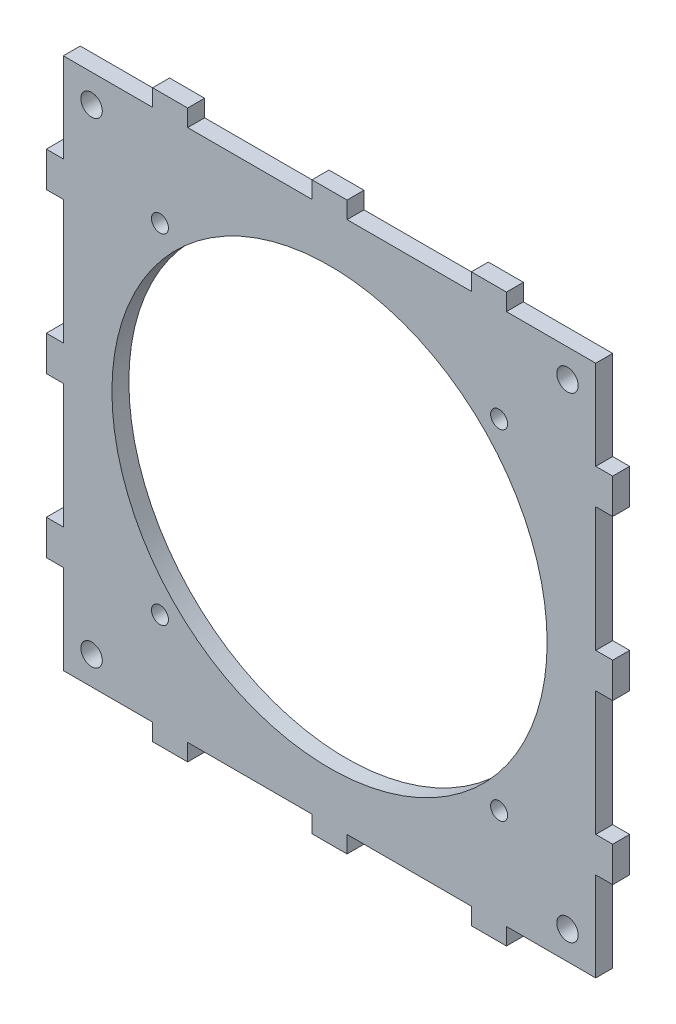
ISO-10303-21;
HEADER;
FILE_DESCRIPTION(('STEP AP214'),'2;1');
FILE_NAME('part.step','',(''),(''),'','','');
FILE_SCHEMA(('AUTOMOTIVE_DESIGN { 1 0 10303 214 1 1 1 1 }'));
ENDSEC;
DATA;
#1=APPLICATION_CONTEXT('core data for automotive mechanical design processes');
#2=APPLICATION_PROTOCOL_DEFINITION('international standard','automotive_design',2000,#1);
#3=PRODUCT_CONTEXT('',#1,'mechanical');
#4=PRODUCT('Part','Part','',(#3));
#5=PRODUCT_RELATED_PRODUCT_CATEGORY('part','',(#4));
#6=PRODUCT_DEFINITION_FORMATION('','',#4);
#7=PRODUCT_DEFINITION_CONTEXT('part definition',#1,'design');
#8=PRODUCT_DEFINITION('design','',#6,#7);
#9=PRODUCT_DEFINITION_SHAPE('','',#8);
#10=(LENGTH_UNIT() NAMED_UNIT(*) SI_UNIT(.MILLI.,.METRE.));
#11=(NAMED_UNIT(*) PLANE_ANGLE_UNIT() SI_UNIT($,.RADIAN.));
#12=(NAMED_UNIT(*) SI_UNIT($,.STERADIAN.) SOLID_ANGLE_UNIT());
#13=UNCERTAINTY_MEASURE_WITH_UNIT(LENGTH_MEASURE(1.E-05),#10,'distance_accuracy_value','');
#14=(GEOMETRIC_REPRESENTATION_CONTEXT(3) GLOBAL_UNCERTAINTY_ASSIGNED_CONTEXT((#13)) GLOBAL_UNIT_ASSIGNED_CONTEXT((#10,
#11,#12)) REPRESENTATION_CONTEXT('',''));
#15=CARTESIAN_POINT('',(0.,0.,0.));
#16=DIRECTION('',(0.,0.,1.));
#17=DIRECTION('',(1.,0.,0.));
#18=AXIS2_PLACEMENT_3D('',#15,#16,#17);
#19=CARTESIAN_POINT('',(0.,3.1,3.));
#20=DIRECTION('',(0.,1.,0.));
#21=DIRECTION('',(-1.,0.,0.));
#22=AXIS2_PLACEMENT_3D('',#19,#20,#21);
#23=PLANE('',#22);
#24=DIRECTION('',(1.,0.,0.));
#25=VECTOR('',#24,1.);
#26=CARTESIAN_POINT('',(0.,3.1,0.));
#27=LINE('',#26,#25);
#28=CARTESIAN_POINT('',(-50.1,3.10000000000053,0.));
#29=VERTEX_POINT('',#28);
#30=CARTESIAN_POINT('',(-47.1,3.10000000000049,0.));
#31=VERTEX_POINT('',#30);
#32=EDGE_CURVE('E402',#29,#31,#27,.T.);
#33=ORIENTED_EDGE('',*,*,#32,.F.);
#34=DIRECTION('',(0.,0.,-1.));
#35=VECTOR('',#34,1.);
#36=CARTESIAN_POINT('',(-50.1,3.10000000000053,3.));
#37=LINE('',#36,#35);
#38=CARTESIAN_POINT('',(-50.1,3.10000000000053,3.));
#39=VERTEX_POINT('',#38);
#40=EDGE_CURVE('E11',#39,#29,#37,.T.);
#41=ORIENTED_EDGE('',*,*,#40,.F.);
#42=DIRECTION('',(1.,0.,0.));
#43=VECTOR('',#42,1.);
#44=CARTESIAN_POINT('',(0.,3.1,3.));
#45=LINE('',#44,#43);
#46=CARTESIAN_POINT('',(-47.1,3.10000000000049,3.));
#47=VERTEX_POINT('',#46);
#48=EDGE_CURVE('E547',#39,#47,#45,.T.);
#49=ORIENTED_EDGE('',*,*,#48,.T.);
#50=DIRECTION('',(0.,0.,-1.));
#51=VECTOR('',#50,1.);
#52=CARTESIAN_POINT('',(-47.1,3.10000000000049,3.));
#53=LINE('',#52,#51);
#54=EDGE_CURVE('E32',#47,#31,#53,.T.);
#55=ORIENTED_EDGE('',*,*,#54,.T.);
#56=EDGE_LOOP('',(#33,#41,#49,#55));
#57=FACE_BOUND('',#56,.T.);
#58=ADVANCED_FACE('F16',(#57),#23,.T.);
#59=CARTESIAN_POINT('',(-50.1,5.60707394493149E-13,3.));
#60=DIRECTION('',(-1.,0.,0.));
#61=DIRECTION('',(0.,-1.,0.));
#62=AXIS2_PLACEMENT_3D('',#59,#60,#61);
#63=PLANE('',#62);
#64=DIRECTION('',(0.,1.,0.));
#65=VECTOR('',#64,1.);
#66=CARTESIAN_POINT('',(-50.1,5.60707394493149E-13,0.));
#67=LINE('',#66,#65);
#68=CARTESIAN_POINT('',(-50.1,-3.09999999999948,0.));
#69=VERTEX_POINT('',#68);
#70=EDGE_CURVE('E404',#69,#29,#67,.T.);
#71=ORIENTED_EDGE('',*,*,#70,.F.);
#72=DIRECTION('',(0.,0.,-1.));
#73=VECTOR('',#72,1.);
#74=CARTESIAN_POINT('',(-50.1,-3.09999999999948,3.));
#75=LINE('',#74,#73);
#76=CARTESIAN_POINT('',(-50.1,-3.09999999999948,3.));
#77=VERTEX_POINT('',#76);
#78=EDGE_CURVE('E24',#77,#69,#75,.T.);
#79=ORIENTED_EDGE('',*,*,#78,.F.);
#80=DIRECTION('',(0.,1.,0.));
#81=VECTOR('',#80,1.);
#82=CARTESIAN_POINT('',(-50.1,5.60707394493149E-13,3.));
#83=LINE('',#82,#81);
#84=EDGE_CURVE('E668',#77,#39,#83,.T.);
#85=ORIENTED_EDGE('',*,*,#84,.T.);
#86=ORIENTED_EDGE('',*,*,#40,.T.);
#87=EDGE_LOOP('',(#71,#79,#85,#86));
#88=FACE_BOUND('',#87,.T.);
#89=ADVANCED_FACE('F667',(#88),#63,.T.);
#90=CARTESIAN_POINT('',(0.,-3.1,3.));
#91=DIRECTION('',(0.,1.,0.));
#92=DIRECTION('',(-1.,0.,0.));
#93=AXIS2_PLACEMENT_3D('',#90,#91,#92);
#94=PLANE('',#93);
#95=DIRECTION('',(1.,0.,0.));
#96=VECTOR('',#95,1.);
#97=CARTESIAN_POINT('',(0.,-3.1,0.));
#98=LINE('',#97,#96);
#99=CARTESIAN_POINT('',(-47.1,-3.09999999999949,0.));
#100=VERTEX_POINT('',#99);
#101=EDGE_CURVE('E407',#69,#100,#98,.T.);
#102=ORIENTED_EDGE('',*,*,#101,.T.);
#103=DIRECTION('',(0.,0.,-1.));
#104=VECTOR('',#103,1.);
#105=CARTESIAN_POINT('',(-47.1,-3.09999999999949,3.));
#106=LINE('',#105,#104);
#107=CARTESIAN_POINT('',(-47.1,-3.09999999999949,3.));
#108=VERTEX_POINT('',#107);
#109=EDGE_CURVE('E652',#108,#100,#106,.T.);
#110=ORIENTED_EDGE('',*,*,#109,.F.);
#111=DIRECTION('',(1.,0.,0.));
#112=VECTOR('',#111,1.);
#113=CARTESIAN_POINT('',(0.,-3.1,3.));
#114=LINE('',#113,#112);
#115=EDGE_CURVE('E658',#77,#108,#114,.T.);
#116=ORIENTED_EDGE('',*,*,#115,.F.);
#117=ORIENTED_EDGE('',*,*,#78,.T.);
#118=EDGE_LOOP('',(#102,#110,#116,#117));
#119=FACE_BOUND('',#118,.T.);
#120=ADVANCED_FACE('F656',(#119),#94,.F.);
#121=CARTESIAN_POINT('',(-47.1,0.,3.));
#122=DIRECTION('',(-1.,0.,0.));
#123=DIRECTION('',(0.,0.,1.));
#124=AXIS2_PLACEMENT_3D('',#121,#122,#123);
#125=PLANE('',#124);
#126=DIRECTION('',(0.,1.,0.));
#127=VECTOR('',#126,1.);
#128=CARTESIAN_POINT('',(-47.1,0.,0.));
#129=LINE('',#128,#127);
#130=CARTESIAN_POINT('',(-47.1,-25.0999999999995,0.));
#131=VERTEX_POINT('',#130);
#132=EDGE_CURVE('E410',#131,#100,#129,.T.);
#133=ORIENTED_EDGE('',*,*,#132,.F.);
#134=DIRECTION('',(0.,0.,-1.));
#135=VECTOR('',#134,1.);
#136=CARTESIAN_POINT('',(-47.1,-25.0999999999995,3.));
#137=LINE('',#136,#135);
#138=CARTESIAN_POINT('',(-47.1,-25.0999999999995,3.));
#139=VERTEX_POINT('',#138);
#140=EDGE_CURVE('E650',#139,#131,#137,.T.);
#141=ORIENTED_EDGE('',*,*,#140,.F.);
#142=DIRECTION('',(0.,1.,0.));
#143=VECTOR('',#142,1.);
#144=CARTESIAN_POINT('',(-47.1,0.,3.));
#145=LINE('',#144,#143);
#146=EDGE_CURVE('E705',#139,#108,#145,.T.);
#147=ORIENTED_EDGE('',*,*,#146,.T.);
#148=ORIENTED_EDGE('',*,*,#109,.T.);
#149=EDGE_LOOP('',(#133,#141,#147,#148));
#150=FACE_BOUND('',#149,.T.);
#151=ADVANCED_FACE('F704',(#150),#125,.T.);
#152=CARTESIAN_POINT('',(-2.61249355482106E-13,-25.1,3.));
#153=DIRECTION('',(0.,1.,0.));
#154=DIRECTION('',(-1.,0.,0.));
#155=AXIS2_PLACEMENT_3D('',#152,#153,#154);
#156=PLANE('',#155);
#157=DIRECTION('',(1.,0.,0.));
#158=VECTOR('',#157,1.);
#159=CARTESIAN_POINT('',(-2.61249355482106E-13,-25.1,0.));
#160=LINE('',#159,#158);
#161=CARTESIAN_POINT('',(-50.1,-25.0999999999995,0.));
#162=VERTEX_POINT('',#161);
#163=EDGE_CURVE('E413',#162,#131,#160,.T.);
#164=ORIENTED_EDGE('',*,*,#163,.F.);
#165=DIRECTION('',(0.,0.,-1.));
#166=VECTOR('',#165,1.);
#167=CARTESIAN_POINT('',(-50.1,-25.0999999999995,3.));
#168=LINE('',#167,#166);
#169=CARTESIAN_POINT('',(-50.1,-25.0999999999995,3.));
#170=VERTEX_POINT('',#169);
#171=EDGE_CURVE('E648',#170,#162,#168,.T.);
#172=ORIENTED_EDGE('',*,*,#171,.F.);
#173=DIRECTION('',(1.,0.,0.));
#174=VECTOR('',#173,1.);
#175=CARTESIAN_POINT('',(-2.61249355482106E-13,-25.1,3.));
#176=LINE('',#175,#174);
#177=EDGE_CURVE('E700',#170,#139,#176,.T.);
#178=ORIENTED_EDGE('',*,*,#177,.T.);
#179=ORIENTED_EDGE('',*,*,#140,.T.);
#180=EDGE_LOOP('',(#164,#172,#178,#179));
#181=FACE_BOUND('',#180,.T.);
#182=ADVANCED_FACE('F698',(#181),#156,.T.);
#183=CARTESIAN_POINT('',(-50.1,5.04636655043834E-13,3.));
#184=DIRECTION('',(1.,0.,0.));
#185=DIRECTION('',(0.,1.,0.));
#186=AXIS2_PLACEMENT_3D('',#183,#184,#185);
#187=PLANE('',#186);
#188=DIRECTION('',(0.,-1.,0.));
#189=VECTOR('',#188,1.);
#190=CARTESIAN_POINT('',(-50.1,5.04636655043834E-13,0.));
#191=LINE('',#190,#189);
#192=CARTESIAN_POINT('',(-50.1,-31.2999999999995,0.));
#193=VERTEX_POINT('',#192);
#194=EDGE_CURVE('E418',#162,#193,#191,.T.);
#195=ORIENTED_EDGE('',*,*,#194,.T.);
#196=DIRECTION('',(0.,0.,-1.));
#197=VECTOR('',#196,1.);
#198=CARTESIAN_POINT('',(-50.1,-31.2999999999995,3.));
#199=LINE('',#198,#197);
#200=CARTESIAN_POINT('',(-50.1,-31.2999999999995,3.));
#201=VERTEX_POINT('',#200);
#202=EDGE_CURVE('E645',#201,#193,#199,.T.);
#203=ORIENTED_EDGE('',*,*,#202,.F.);
#204=DIRECTION('',(0.,-1.,0.));
#205=VECTOR('',#204,1.);
#206=CARTESIAN_POINT('',(-50.1,5.04636655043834E-13,3.));
#207=LINE('',#206,#205);
#208=EDGE_CURVE('E694',#170,#201,#207,.T.);
#209=ORIENTED_EDGE('',*,*,#208,.F.);
#210=ORIENTED_EDGE('',*,*,#171,.T.);
#211=EDGE_LOOP('',(#195,#203,#209,#210));
#212=FACE_BOUND('',#211,.T.);
#213=ADVANCED_FACE('F693',(#212),#187,.F.);
#214=CARTESIAN_POINT('',(-3.61978965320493E-13,-31.3,3.));
#215=DIRECTION('',(0.,1.,0.));
#216=DIRECTION('',(-1.,0.,0.));
#217=AXIS2_PLACEMENT_3D('',#214,#215,#216);
#218=PLANE('',#217);
#219=DIRECTION('',(1.,0.,0.));
#220=VECTOR('',#219,1.);
#221=CARTESIAN_POINT('',(-3.61978965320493E-13,-31.3,0.));
#222=LINE('',#221,#220);
#223=CARTESIAN_POINT('',(-47.1,-31.2999999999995,0.));
#224=VERTEX_POINT('',#223);
#225=EDGE_CURVE('E420',#193,#224,#222,.T.);
#226=ORIENTED_EDGE('',*,*,#225,.T.);
#227=DIRECTION('',(0.,0.,-1.));
#228=VECTOR('',#227,1.);
#229=CARTESIAN_POINT('',(-47.1,-31.2999999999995,3.));
#230=LINE('',#229,#228);
#231=CARTESIAN_POINT('',(-47.1,-31.2999999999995,3.));
#232=VERTEX_POINT('',#231);
#233=EDGE_CURVE('E643',#232,#224,#230,.T.);
#234=ORIENTED_EDGE('',*,*,#233,.F.);
#235=DIRECTION('',(1.,0.,0.));
#236=VECTOR('',#235,1.);
#237=CARTESIAN_POINT('',(-3.61978965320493E-13,-31.3,3.));
#238=LINE('',#237,#236);
#239=EDGE_CURVE('E690',#201,#232,#238,.T.);
#240=ORIENTED_EDGE('',*,*,#239,.F.);
#241=ORIENTED_EDGE('',*,*,#202,.T.);
#242=EDGE_LOOP('',(#226,#234,#240,#241));
#243=FACE_BOUND('',#242,.T.);
#244=ADVANCED_FACE('F688',(#243),#218,.F.);
#245=CARTESIAN_POINT('',(-47.1,-47.1,0.));
#246=VERTEX_POINT('',#245);
#247=EDGE_CURVE('E415',#246,#224,#129,.T.);
#248=ORIENTED_EDGE('',*,*,#247,.F.);
#249=DIRECTION('',(0.,0.,-1.));
#250=VECTOR('',#249,1.);
#251=CARTESIAN_POINT('',(-47.1,-47.1,3.));
#252=LINE('',#251,#250);
#253=CARTESIAN_POINT('',(-47.1,-47.1,3.));
#254=VERTEX_POINT('',#253);
#255=EDGE_CURVE('E641',#254,#246,#252,.T.);
#256=ORIENTED_EDGE('',*,*,#255,.F.);
#257=EDGE_CURVE('E685',#254,#232,#145,.T.);
#258=ORIENTED_EDGE('',*,*,#257,.T.);
#259=ORIENTED_EDGE('',*,*,#233,.T.);
#260=EDGE_LOOP('',(#248,#256,#258,#259));
#261=FACE_BOUND('',#260,.T.);
#262=ADVANCED_FACE('F680',(#261),#125,.T.);
#263=CARTESIAN_POINT('',(0.,-47.1,3.));
#264=DIRECTION('',(0.,1.,0.));
#265=DIRECTION('',(0.,0.,1.));
#266=AXIS2_PLACEMENT_3D('',#263,#264,#265);
#267=PLANE('',#266);
#268=DIRECTION('',(1.,0.,0.));
#269=VECTOR('',#268,1.);
#270=CARTESIAN_POINT('',(0.,-47.1,0.));
#271=LINE('',#270,#269);
#272=CARTESIAN_POINT('',(-31.3000000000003,-47.1,0.));
#273=VERTEX_POINT('',#272);
#274=EDGE_CURVE('E423',#246,#273,#271,.T.);
#275=ORIENTED_EDGE('',*,*,#274,.T.);
#276=DIRECTION('',(0.,0.,-1.));
#277=VECTOR('',#276,1.);
#278=CARTESIAN_POINT('',(-31.3000000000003,-47.1,3.));
#279=LINE('',#278,#277);
#280=CARTESIAN_POINT('',(-31.3000000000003,-47.1,3.));
#281=VERTEX_POINT('',#280);
#282=EDGE_CURVE('E639',#281,#273,#279,.T.);
#283=ORIENTED_EDGE('',*,*,#282,.F.);
#284=DIRECTION('',(1.,0.,0.));
#285=VECTOR('',#284,1.);
#286=CARTESIAN_POINT('',(0.,-47.1,3.));
#287=LINE('',#286,#285);
#288=EDGE_CURVE('E709',#254,#281,#287,.T.);
#289=ORIENTED_EDGE('',*,*,#288,.F.);
#290=ORIENTED_EDGE('',*,*,#255,.T.);
#291=EDGE_LOOP('',(#275,#283,#289,#290));
#292=FACE_BOUND('',#291,.T.);
#293=ADVANCED_FACE('F979',(#292),#267,.F.);
#294=CARTESIAN_POINT('',(-31.3,2.17187379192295E-13,3.));
#295=DIRECTION('',(-1.,0.,0.));
#296=DIRECTION('',(0.,-1.,0.));
#297=AXIS2_PLACEMENT_3D('',#294,#295,#296);
#298=PLANE('',#297);
#299=DIRECTION('',(0.,1.,0.));
#300=VECTOR('',#299,1.);
#301=CARTESIAN_POINT('',(-31.3,2.17187379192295E-13,0.));
#302=LINE('',#301,#300);
#303=CARTESIAN_POINT('',(-31.3000000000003,-50.1,0.));
#304=VERTEX_POINT('',#303);
#305=EDGE_CURVE('E426',#304,#273,#302,.T.);
#306=ORIENTED_EDGE('',*,*,#305,.F.);
#307=DIRECTION('',(0.,0.,-1.));
#308=VECTOR('',#307,1.);
#309=CARTESIAN_POINT('',(-31.3000000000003,-50.1,3.));
#310=LINE('',#309,#308);
#311=CARTESIAN_POINT('',(-31.3000000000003,-50.1,3.));
#312=VERTEX_POINT('',#311);
#313=EDGE_CURVE('E637',#312,#304,#310,.T.);
#314=ORIENTED_EDGE('',*,*,#313,.F.);
#315=DIRECTION('',(0.,1.,0.));
#316=VECTOR('',#315,1.);
#317=CARTESIAN_POINT('',(-31.3,2.17187379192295E-13,3.));
#318=LINE('',#317,#316);
#319=EDGE_CURVE('E710',#312,#281,#318,.T.);
#320=ORIENTED_EDGE('',*,*,#319,.T.);
#321=ORIENTED_EDGE('',*,*,#282,.T.);
#322=EDGE_LOOP('',(#306,#314,#320,#321));
#323=FACE_BOUND('',#322,.T.);
#324=ADVANCED_FACE('F975',(#323),#298,.T.);
#325=CARTESIAN_POINT('',(-3.36424436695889E-13,-50.1,3.));
#326=DIRECTION('',(0.,-1.,0.));
#327=DIRECTION('',(1.,0.,0.));
#328=AXIS2_PLACEMENT_3D('',#325,#326,#327);
#329=PLANE('',#328);
#330=DIRECTION('',(-1.,0.,0.));
#331=VECTOR('',#330,1.);
#332=CARTESIAN_POINT('',(-3.36424436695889E-13,-50.1,0.));
#333=LINE('',#332,#331);
#334=CARTESIAN_POINT('',(-25.1000000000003,-50.1,0.));
#335=VERTEX_POINT('',#334);
#336=EDGE_CURVE('E431',#335,#304,#333,.T.);
#337=ORIENTED_EDGE('',*,*,#336,.F.);
#338=DIRECTION('',(0.,0.,-1.));
#339=VECTOR('',#338,1.);
#340=CARTESIAN_POINT('',(-25.1000000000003,-50.1,3.));
#341=LINE('',#340,#339);
#342=CARTESIAN_POINT('',(-25.1000000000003,-50.1,3.));
#343=VERTEX_POINT('',#342);
#344=EDGE_CURVE('E635',#343,#335,#341,.T.);
#345=ORIENTED_EDGE('',*,*,#344,.F.);
#346=DIRECTION('',(-1.,0.,0.));
#347=VECTOR('',#346,1.);
#348=CARTESIAN_POINT('',(-3.36424436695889E-13,-50.1,3.));
#349=LINE('',#348,#347);
#350=EDGE_CURVE('E1541',#343,#312,#349,.T.);
#351=ORIENTED_EDGE('',*,*,#350,.T.);
#352=ORIENTED_EDGE('',*,*,#313,.T.);
#353=EDGE_LOOP('',(#337,#345,#351,#352));
#354=FACE_BOUND('',#353,.T.);
#355=ADVANCED_FACE('F978',(#354),#329,.T.);
#356=CARTESIAN_POINT('',(-25.1,1.7416623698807E-13,3.));
#357=DIRECTION('',(-1.,0.,0.));
#358=DIRECTION('',(0.,-1.,0.));
#359=AXIS2_PLACEMENT_3D('',#356,#357,#358);
#360=PLANE('',#359);
#361=DIRECTION('',(0.,1.,0.));
#362=VECTOR('',#361,1.);
#363=CARTESIAN_POINT('',(-25.1,1.7416623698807E-13,0.));
#364=LINE('',#363,#362);
#365=CARTESIAN_POINT('',(-25.1000000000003,-47.1,0.));
#366=VERTEX_POINT('',#365);
#367=EDGE_CURVE('E434',#335,#366,#364,.T.);
#368=ORIENTED_EDGE('',*,*,#367,.T.);
#369=DIRECTION('',(0.,0.,-1.));
#370=VECTOR('',#369,1.);
#371=CARTESIAN_POINT('',(-25.1000000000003,-47.1,3.));
#372=LINE('',#371,#370);
#373=CARTESIAN_POINT('',(-25.1000000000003,-47.1,3.));
#374=VERTEX_POINT('',#373);
#375=EDGE_CURVE('E632',#374,#366,#372,.T.);
#376=ORIENTED_EDGE('',*,*,#375,.F.);
#377=DIRECTION('',(0.,1.,0.));
#378=VECTOR('',#377,1.);
#379=CARTESIAN_POINT('',(-25.1,1.7416623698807E-13,3.));
#380=LINE('',#379,#378);
#381=EDGE_CURVE('E917',#343,#374,#380,.T.);
#382=ORIENTED_EDGE('',*,*,#381,.F.);
#383=ORIENTED_EDGE('',*,*,#344,.T.);
#384=EDGE_LOOP('',(#368,#376,#382,#383));
#385=FACE_BOUND('',#384,.T.);
#386=ADVANCED_FACE('F983',(#385),#360,.F.);
#387=CARTESIAN_POINT('',(-3.10000000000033,-47.1,0.));
#388=VERTEX_POINT('',#387);
#389=EDGE_CURVE('E428',#366,#388,#271,.T.);
#390=ORIENTED_EDGE('',*,*,#389,.T.);
#391=DIRECTION('',(0.,0.,-1.));
#392=VECTOR('',#391,1.);
#393=CARTESIAN_POINT('',(-3.10000000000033,-47.1,3.));
#394=LINE('',#393,#392);
#395=CARTESIAN_POINT('',(-3.10000000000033,-47.1,3.));
#396=VERTEX_POINT('',#395);
#397=EDGE_CURVE('E630',#396,#388,#394,.T.);
#398=ORIENTED_EDGE('',*,*,#397,.F.);
#399=EDGE_CURVE('E713',#374,#396,#287,.T.);
#400=ORIENTED_EDGE('',*,*,#399,.F.);
#401=ORIENTED_EDGE('',*,*,#375,.T.);
#402=EDGE_LOOP('',(#390,#398,#400,#401));
#403=FACE_BOUND('',#402,.T.);
#404=ADVANCED_FACE('F899',(#403),#267,.F.);
#405=CARTESIAN_POINT('',(-3.1,0.,3.));
#406=DIRECTION('',(-1.,0.,0.));
#407=DIRECTION('',(0.,-1.,0.));
#408=AXIS2_PLACEMENT_3D('',#405,#406,#407);
#409=PLANE('',#408);
#410=DIRECTION('',(0.,1.,0.));
#411=VECTOR('',#410,1.);
#412=CARTESIAN_POINT('',(-3.1,0.,0.));
#413=LINE('',#412,#411);
#414=CARTESIAN_POINT('',(-3.10000000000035,-50.1,0.));
#415=VERTEX_POINT('',#414);
#416=EDGE_CURVE('E436',#415,#388,#413,.T.);
#417=ORIENTED_EDGE('',*,*,#416,.F.);
#418=DIRECTION('',(0.,0.,-1.));
#419=VECTOR('',#418,1.);
#420=CARTESIAN_POINT('',(-3.10000000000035,-50.1,3.));
#421=LINE('',#420,#419);
#422=CARTESIAN_POINT('',(-3.10000000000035,-50.1,3.));
#423=VERTEX_POINT('',#422);
#424=EDGE_CURVE('E628',#423,#415,#421,.T.);
#425=ORIENTED_EDGE('',*,*,#424,.F.);
#426=DIRECTION('',(0.,1.,0.));
#427=VECTOR('',#426,1.);
#428=CARTESIAN_POINT('',(-3.1,0.,3.));
#429=LINE('',#428,#427);
#430=EDGE_CURVE('E910',#423,#396,#429,.T.);
#431=ORIENTED_EDGE('',*,*,#430,.T.);
#432=ORIENTED_EDGE('',*,*,#397,.T.);
#433=EDGE_LOOP('',(#417,#425,#431,#432));
#434=FACE_BOUND('',#433,.T.);
#435=ADVANCED_FACE('F908',(#434),#409,.T.);
#436=CARTESIAN_POINT('',(-3.36424436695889E-13,-50.1,3.));
#437=DIRECTION('',(0.,-1.,0.));
#438=DIRECTION('',(1.,0.,0.));
#439=AXIS2_PLACEMENT_3D('',#436,#437,#438);
#440=PLANE('',#439);
#441=DIRECTION('',(-1.,0.,0.));
#442=VECTOR('',#441,1.);
#443=CARTESIAN_POINT('',(-3.36424436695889E-13,-50.1,0.));
#444=LINE('',#443,#442);
#445=CARTESIAN_POINT('',(3.09999999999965,-50.1,0.));
#446=VERTEX_POINT('',#445);
#447=EDGE_CURVE('E439',#446,#415,#444,.T.);
#448=ORIENTED_EDGE('',*,*,#447,.F.);
#449=DIRECTION('',(0.,0.,-1.));
#450=VECTOR('',#449,1.);
#451=CARTESIAN_POINT('',(3.09999999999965,-50.1,3.));
#452=LINE('',#451,#450);
#453=CARTESIAN_POINT('',(3.09999999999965,-50.1,3.));
#454=VERTEX_POINT('',#453);
#455=EDGE_CURVE('E626',#454,#446,#452,.T.);
#456=ORIENTED_EDGE('',*,*,#455,.F.);
#457=DIRECTION('',(-1.,0.,0.));
#458=VECTOR('',#457,1.);
#459=CARTESIAN_POINT('',(-3.36424436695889E-13,-50.1,3.));
#460=LINE('',#459,#458);
#461=EDGE_CURVE('E913',#454,#423,#460,.T.);
#462=ORIENTED_EDGE('',*,*,#461,.T.);
#463=ORIENTED_EDGE('',*,*,#424,.T.);
#464=EDGE_LOOP('',(#448,#456,#462,#463));
#465=FACE_BOUND('',#464,.T.);
#466=ADVANCED_FACE('F945',(#465),#440,.T.);
#467=CARTESIAN_POINT('',(3.1,0.,3.));
#468=DIRECTION('',(-1.,0.,0.));
#469=DIRECTION('',(0.,-1.,0.));
#470=AXIS2_PLACEMENT_3D('',#467,#468,#469);
#471=PLANE('',#470);
#472=DIRECTION('',(0.,1.,0.));
#473=VECTOR('',#472,1.);
#474=CARTESIAN_POINT('',(3.1,0.,0.));
#475=LINE('',#474,#473);
#476=CARTESIAN_POINT('',(3.09999999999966,-47.1,0.));
#477=VERTEX_POINT('',#476);
#478=EDGE_CURVE('E442',#446,#477,#475,.T.);
#479=ORIENTED_EDGE('',*,*,#478,.T.);
#480=DIRECTION('',(0.,0.,-1.));
#481=VECTOR('',#480,1.);
#482=CARTESIAN_POINT('',(3.09999999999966,-47.1,3.));
#483=LINE('',#482,#481);
#484=CARTESIAN_POINT('',(3.09999999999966,-47.1,3.));
#485=VERTEX_POINT('',#484);
#486=EDGE_CURVE('E623',#485,#477,#483,.T.);
#487=ORIENTED_EDGE('',*,*,#486,.F.);
#488=DIRECTION('',(0.,1.,0.));
#489=VECTOR('',#488,1.);
#490=CARTESIAN_POINT('',(3.1,0.,3.));
#491=LINE('',#490,#489);
#492=EDGE_CURVE('E915',#454,#485,#491,.T.);
#493=ORIENTED_EDGE('',*,*,#492,.F.);
#494=ORIENTED_EDGE('',*,*,#455,.T.);
#495=EDGE_LOOP('',(#479,#487,#493,#494));
#496=FACE_BOUND('',#495,.T.);
#497=ADVANCED_FACE('F946',(#496),#471,.F.);
#498=CARTESIAN_POINT('',(25.0999999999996,-47.1,0.));
#499=VERTEX_POINT('',#498);
#500=EDGE_CURVE('E444',#477,#499,#271,.T.);
#501=ORIENTED_EDGE('',*,*,#500,.T.);
#502=DIRECTION('',(0.,0.,-1.));
#503=VECTOR('',#502,1.);
#504=CARTESIAN_POINT('',(25.0999999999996,-47.1,3.));
#505=LINE('',#504,#503);
#506=CARTESIAN_POINT('',(25.0999999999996,-47.1,3.));
#507=VERTEX_POINT('',#506);
#508=EDGE_CURVE('E621',#507,#499,#505,.T.);
#509=ORIENTED_EDGE('',*,*,#508,.F.);
#510=EDGE_CURVE('E918',#485,#507,#287,.T.);
#511=ORIENTED_EDGE('',*,*,#510,.F.);
#512=ORIENTED_EDGE('',*,*,#486,.T.);
#513=EDGE_LOOP('',(#501,#509,#511,#512));
#514=FACE_BOUND('',#513,.T.);
#515=ADVANCED_FACE('F934',(#514),#267,.F.);
#516=CARTESIAN_POINT('',(25.1,-1.7416623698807E-13,3.));
#517=DIRECTION('',(-1.,0.,0.));
#518=DIRECTION('',(0.,-1.,0.));
#519=AXIS2_PLACEMENT_3D('',#516,#517,#518);
#520=PLANE('',#519);
#521=DIRECTION('',(0.,1.,0.));
#522=VECTOR('',#521,1.);
#523=CARTESIAN_POINT('',(25.1,-1.7416623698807E-13,0.));
#524=LINE('',#523,#522);
#525=CARTESIAN_POINT('',(25.0999999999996,-50.1,0.));
#526=VERTEX_POINT('',#525);
#527=EDGE_CURVE('E445',#526,#499,#524,.T.);
#528=ORIENTED_EDGE('',*,*,#527,.F.);
#529=DIRECTION('',(0.,0.,-1.));
#530=VECTOR('',#529,1.);
#531=CARTESIAN_POINT('',(25.0999999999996,-50.1,3.));
#532=LINE('',#531,#530);
#533=CARTESIAN_POINT('',(25.0999999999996,-50.1,3.));
#534=VERTEX_POINT('',#533);
#535=EDGE_CURVE('E619',#534,#526,#532,.T.);
#536=ORIENTED_EDGE('',*,*,#535,.F.);
#537=DIRECTION('',(0.,1.,0.));
#538=VECTOR('',#537,1.);
#539=CARTESIAN_POINT('',(25.1,-1.7416623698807E-13,3.));
#540=LINE('',#539,#538);
#541=EDGE_CURVE('E923',#534,#507,#540,.T.);
#542=ORIENTED_EDGE('',*,*,#541,.T.);
#543=ORIENTED_EDGE('',*,*,#508,.T.);
#544=EDGE_LOOP('',(#528,#536,#542,#543));
#545=FACE_BOUND('',#544,.T.);
#546=ADVANCED_FACE('F937',(#545),#520,.T.);
#547=CARTESIAN_POINT('',(-3.36424436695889E-13,-50.1,3.));
#548=DIRECTION('',(0.,1.,0.));
#549=DIRECTION('',(-1.,0.,0.));
#550=AXIS2_PLACEMENT_3D('',#547,#548,#549);
#551=PLANE('',#550);
#552=DIRECTION('',(1.,0.,0.));
#553=VECTOR('',#552,1.);
#554=CARTESIAN_POINT('',(-3.36424436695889E-13,-50.1,0.));
#555=LINE('',#554,#553);
#556=CARTESIAN_POINT('',(31.2999999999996,-50.1,0.));
#557=VERTEX_POINT('',#556);
#558=EDGE_CURVE('E448',#526,#557,#555,.T.);
#559=ORIENTED_EDGE('',*,*,#558,.T.);
#560=DIRECTION('',(0.,0.,-1.));
#561=VECTOR('',#560,1.);
#562=CARTESIAN_POINT('',(31.2999999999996,-50.1,3.));
#563=LINE('',#562,#561);
#564=CARTESIAN_POINT('',(31.2999999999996,-50.1,3.));
#565=VERTEX_POINT('',#564);
#566=EDGE_CURVE('E616',#565,#557,#563,.T.);
#567=ORIENTED_EDGE('',*,*,#566,.F.);
#568=DIRECTION('',(1.,0.,0.));
#569=VECTOR('',#568,1.);
#570=CARTESIAN_POINT('',(-3.36424436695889E-13,-50.1,3.));
#571=LINE('',#570,#569);
#572=EDGE_CURVE('E925',#534,#565,#571,.T.);
#573=ORIENTED_EDGE('',*,*,#572,.F.);
#574=ORIENTED_EDGE('',*,*,#535,.T.);
#575=EDGE_LOOP('',(#559,#567,#573,#574));
#576=FACE_BOUND('',#575,.T.);
#577=ADVANCED_FACE('F940',(#576),#551,.F.);
#578=CARTESIAN_POINT('',(31.3,-2.17187379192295E-13,3.));
#579=DIRECTION('',(-1.,0.,0.));
#580=DIRECTION('',(0.,-1.,0.));
#581=AXIS2_PLACEMENT_3D('',#578,#579,#580);
#582=PLANE('',#581);
#583=DIRECTION('',(0.,1.,0.));
#584=VECTOR('',#583,1.);
#585=CARTESIAN_POINT('',(31.3,-2.17187379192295E-13,0.));
#586=LINE('',#585,#584);
#587=CARTESIAN_POINT('',(31.3,-47.1,0.));
#588=VERTEX_POINT('',#587);
#589=EDGE_CURVE('E450',#557,#588,#586,.T.);
#590=ORIENTED_EDGE('',*,*,#589,.T.);
#591=DIRECTION('',(0.,0.,-1.));
#592=VECTOR('',#591,1.);
#593=CARTESIAN_POINT('',(31.3,-47.1,3.));
#594=LINE('',#593,#592);
#595=CARTESIAN_POINT('',(31.3,-47.1,3.));
#596=VERTEX_POINT('',#595);
#597=EDGE_CURVE('E613',#596,#588,#594,.T.);
#598=ORIENTED_EDGE('',*,*,#597,.F.);
#599=DIRECTION('',(0.,1.,0.));
#600=VECTOR('',#599,1.);
#601=CARTESIAN_POINT('',(31.3,-2.17187379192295E-13,3.));
#602=LINE('',#601,#600);
#603=EDGE_CURVE('E863',#565,#596,#602,.T.);
#604=ORIENTED_EDGE('',*,*,#603,.F.);
#605=ORIENTED_EDGE('',*,*,#566,.T.);
#606=EDGE_LOOP('',(#590,#598,#604,#605));
#607=FACE_BOUND('',#606,.T.);
#608=ADVANCED_FACE('F942',(#607),#582,.F.);
#609=CARTESIAN_POINT('',(47.1,-47.1,0.));
#610=VERTEX_POINT('',#609);
#611=EDGE_CURVE('E427',#588,#610,#271,.T.);
#612=ORIENTED_EDGE('',*,*,#611,.T.);
#613=DIRECTION('',(0.,0.,-1.));
#614=VECTOR('',#613,1.);
#615=CARTESIAN_POINT('',(47.1,-47.1,3.));
#616=LINE('',#615,#614);
#617=CARTESIAN_POINT('',(47.1,-47.1,3.));
#618=VERTEX_POINT('',#617);
#619=EDGE_CURVE('E610',#618,#610,#616,.T.);
#620=ORIENTED_EDGE('',*,*,#619,.F.);
#621=EDGE_CURVE('E712',#596,#618,#287,.T.);
#622=ORIENTED_EDGE('',*,*,#621,.F.);
#623=ORIENTED_EDGE('',*,*,#597,.T.);
#624=EDGE_LOOP('',(#612,#620,#622,#623));
#625=FACE_BOUND('',#624,.T.);
#626=ADVANCED_FACE('F889',(#625),#267,.F.);
#627=CARTESIAN_POINT('',(47.1,0.,3.));
#628=DIRECTION('',(-1.,0.,0.));
#629=DIRECTION('',(0.,0.,1.));
#630=AXIS2_PLACEMENT_3D('',#627,#628,#629);
#631=PLANE('',#630);
#632=DIRECTION('',(0.,1.,0.));
#633=VECTOR('',#632,1.);
#634=CARTESIAN_POINT('',(47.1,0.,0.));
#635=LINE('',#634,#633);
#636=CARTESIAN_POINT('',(47.1,-31.3,0.));
#637=VERTEX_POINT('',#636);
#638=EDGE_CURVE('E452',#610,#637,#635,.T.);
#639=ORIENTED_EDGE('',*,*,#638,.T.);
#640=DIRECTION('',(0.,0.,-1.));
#641=VECTOR('',#640,1.);
#642=CARTESIAN_POINT('',(47.1,-31.3,3.));
#643=LINE('',#642,#641);
#644=CARTESIAN_POINT('',(47.1,-31.3,3.));
#645=VERTEX_POINT('',#644);
#646=EDGE_CURVE('E608',#645,#637,#643,.T.);
#647=ORIENTED_EDGE('',*,*,#646,.F.);
#648=DIRECTION('',(0.,1.,0.));
#649=VECTOR('',#648,1.);
#650=CARTESIAN_POINT('',(47.1,0.,3.));
#651=LINE('',#650,#649);
#652=EDGE_CURVE('E742',#618,#645,#651,.T.);
#653=ORIENTED_EDGE('',*,*,#652,.F.);
#654=ORIENTED_EDGE('',*,*,#619,.T.);
#655=EDGE_LOOP('',(#639,#647,#653,#654));
#656=FACE_BOUND('',#655,.T.);
#657=ADVANCED_FACE('F884',(#656),#631,.F.);
#658=CARTESIAN_POINT('',(0.,-31.3,3.));
#659=DIRECTION('',(0.,-1.,0.));
#660=DIRECTION('',(1.,0.,0.));
#661=AXIS2_PLACEMENT_3D('',#658,#659,#660);
#662=PLANE('',#661);
#663=DIRECTION('',(-1.,0.,0.));
#664=VECTOR('',#663,1.);
#665=CARTESIAN_POINT('',(0.,-31.3,0.));
#666=LINE('',#665,#664);
#667=CARTESIAN_POINT('',(50.1,-31.3,0.));
#668=VERTEX_POINT('',#667);
#669=EDGE_CURVE('E455',#668,#637,#666,.T.);
#670=ORIENTED_EDGE('',*,*,#669,.F.);
#671=DIRECTION('',(0.,0.,-1.));
#672=VECTOR('',#671,1.);
#673=CARTESIAN_POINT('',(50.1,-31.3,3.));
#674=LINE('',#673,#672);
#675=CARTESIAN_POINT('',(50.1,-31.3,3.));
#676=VERTEX_POINT('',#675);
#677=EDGE_CURVE('E606',#676,#668,#674,.T.);
#678=ORIENTED_EDGE('',*,*,#677,.F.);
#679=DIRECTION('',(-1.,0.,0.));
#680=VECTOR('',#679,1.);
#681=CARTESIAN_POINT('',(0.,-31.3,3.));
#682=LINE('',#681,#680);
#683=EDGE_CURVE('E862',#676,#645,#682,.T.);
#684=ORIENTED_EDGE('',*,*,#683,.T.);
#685=ORIENTED_EDGE('',*,*,#646,.T.);
#686=EDGE_LOOP('',(#670,#678,#684,#685));
#687=FACE_BOUND('',#686,.T.);
#688=ADVANCED_FACE('F878',(#687),#662,.T.);
#689=CARTESIAN_POINT('',(50.1,-1.68212218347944E-13,3.));
#690=DIRECTION('',(1.,0.,0.));
#691=DIRECTION('',(0.,1.,0.));
#692=AXIS2_PLACEMENT_3D('',#689,#690,#691);
#693=PLANE('',#692);
#694=DIRECTION('',(0.,-1.,0.));
#695=VECTOR('',#694,1.);
#696=CARTESIAN_POINT('',(50.1,-1.68212218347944E-13,0.));
#697=LINE('',#696,#695);
#698=CARTESIAN_POINT('',(50.1,-25.1,0.));
#699=VERTEX_POINT('',#698);
#700=EDGE_CURVE('E460',#699,#668,#697,.T.);
#701=ORIENTED_EDGE('',*,*,#700,.F.);
#702=DIRECTION('',(0.,0.,-1.));
#703=VECTOR('',#702,1.);
#704=CARTESIAN_POINT('',(50.1,-25.1,3.));
#705=LINE('',#704,#703);
#706=CARTESIAN_POINT('',(50.1,-25.1,3.));
#707=VERTEX_POINT('',#706);
#708=EDGE_CURVE('E604',#707,#699,#705,.T.);
#709=ORIENTED_EDGE('',*,*,#708,.F.);
#710=DIRECTION('',(0.,-1.,0.));
#711=VECTOR('',#710,1.);
#712=CARTESIAN_POINT('',(50.1,-1.68212218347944E-13,3.));
#713=LINE('',#712,#711);
#714=EDGE_CURVE('E866',#707,#676,#713,.T.);
#715=ORIENTED_EDGE('',*,*,#714,.T.);
#716=ORIENTED_EDGE('',*,*,#677,.T.);
#717=EDGE_LOOP('',(#701,#709,#715,#716));
#718=FACE_BOUND('',#717,.T.);
#719=ADVANCED_FACE('F875',(#718),#693,.T.);
#720=CARTESIAN_POINT('',(0.,-25.1,3.));
#721=DIRECTION('',(0.,-1.,0.));
#722=DIRECTION('',(1.,0.,0.));
#723=AXIS2_PLACEMENT_3D('',#720,#721,#722);
#724=PLANE('',#723);
#725=DIRECTION('',(-1.,0.,0.));
#726=VECTOR('',#725,1.);
#727=CARTESIAN_POINT('',(0.,-25.1,0.));
#728=LINE('',#727,#726);
#729=CARTESIAN_POINT('',(47.1,-25.1,0.));
#730=VERTEX_POINT('',#729);
#731=EDGE_CURVE('E463',#699,#730,#728,.T.);
#732=ORIENTED_EDGE('',*,*,#731,.T.);
#733=DIRECTION('',(0.,0.,-1.));
#734=VECTOR('',#733,1.);
#735=CARTESIAN_POINT('',(47.1,-25.1,3.));
#736=LINE('',#735,#734);
#737=CARTESIAN_POINT('',(47.1,-25.1,3.));
#738=VERTEX_POINT('',#737);
#739=EDGE_CURVE('E601',#738,#730,#736,.T.);
#740=ORIENTED_EDGE('',*,*,#739,.F.);
#741=DIRECTION('',(-1.,0.,0.));
#742=VECTOR('',#741,1.);
#743=CARTESIAN_POINT('',(0.,-25.1,3.));
#744=LINE('',#743,#742);
#745=EDGE_CURVE('E837',#707,#738,#744,.T.);
#746=ORIENTED_EDGE('',*,*,#745,.F.);
#747=ORIENTED_EDGE('',*,*,#708,.T.);
#748=EDGE_LOOP('',(#732,#740,#746,#747));
#749=FACE_BOUND('',#748,.T.);
#750=ADVANCED_FACE('F873',(#749),#724,.F.);
#751=CARTESIAN_POINT('',(47.1,-3.10000000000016,0.));
#752=VERTEX_POINT('',#751);
#753=EDGE_CURVE('E457',#730,#752,#635,.T.);
#754=ORIENTED_EDGE('',*,*,#753,.T.);
#755=DIRECTION('',(0.,0.,-1.));
#756=VECTOR('',#755,1.);
#757=CARTESIAN_POINT('',(47.1,-3.10000000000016,3.));
#758=LINE('',#757,#756);
#759=CARTESIAN_POINT('',(47.1,-3.10000000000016,3.));
#760=VERTEX_POINT('',#759);
#761=EDGE_CURVE('E599',#760,#752,#758,.T.);
#762=ORIENTED_EDGE('',*,*,#761,.F.);
#763=EDGE_CURVE('E833',#738,#760,#651,.T.);
#764=ORIENTED_EDGE('',*,*,#763,.F.);
#765=ORIENTED_EDGE('',*,*,#739,.T.);
#766=EDGE_LOOP('',(#754,#762,#764,#765));
#767=FACE_BOUND('',#766,.T.);
#768=ADVANCED_FACE('F818',(#767),#631,.F.);
#769=CARTESIAN_POINT('',(0.,-3.1,3.));
#770=DIRECTION('',(0.,-1.,0.));
#771=DIRECTION('',(1.,0.,0.));
#772=AXIS2_PLACEMENT_3D('',#769,#770,#771);
#773=PLANE('',#772);
#774=DIRECTION('',(-1.,0.,0.));
#775=VECTOR('',#774,1.);
#776=CARTESIAN_POINT('',(0.,-3.1,0.));
#777=LINE('',#776,#775);
#778=CARTESIAN_POINT('',(50.1,-3.10000000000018,0.));
#779=VERTEX_POINT('',#778);
#780=EDGE_CURVE('E465',#779,#752,#777,.T.);
#781=ORIENTED_EDGE('',*,*,#780,.F.);
#782=DIRECTION('',(0.,0.,-1.));
#783=VECTOR('',#782,1.);
#784=CARTESIAN_POINT('',(50.1,-3.10000000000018,3.));
#785=LINE('',#784,#783);
#786=CARTESIAN_POINT('',(50.1,-3.10000000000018,3.));
#787=VERTEX_POINT('',#786);
#788=EDGE_CURVE('E597',#787,#779,#785,.T.);
#789=ORIENTED_EDGE('',*,*,#788,.F.);
#790=DIRECTION('',(-1.,0.,0.));
#791=VECTOR('',#790,1.);
#792=CARTESIAN_POINT('',(0.,-3.1,3.));
#793=LINE('',#792,#791);
#794=EDGE_CURVE('E829',#787,#760,#793,.T.);
#795=ORIENTED_EDGE('',*,*,#794,.T.);
#796=ORIENTED_EDGE('',*,*,#761,.T.);
#797=EDGE_LOOP('',(#781,#789,#795,#796));
#798=FACE_BOUND('',#797,.T.);
#799=ADVANCED_FACE('F827',(#798),#773,.T.);
#800=CARTESIAN_POINT('',(50.1,-2.2428295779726E-13,3.));
#801=DIRECTION('',(1.,0.,0.));
#802=DIRECTION('',(0.,1.,0.));
#803=AXIS2_PLACEMENT_3D('',#800,#801,#802);
#804=PLANE('',#803);
#805=DIRECTION('',(0.,-1.,0.));
#806=VECTOR('',#805,1.);
#807=CARTESIAN_POINT('',(50.1,-2.2428295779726E-13,0.));
#808=LINE('',#807,#806);
#809=CARTESIAN_POINT('',(50.1,3.09999999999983,0.));
#810=VERTEX_POINT('',#809);
#811=EDGE_CURVE('E468',#810,#779,#808,.T.);
#812=ORIENTED_EDGE('',*,*,#811,.F.);
#813=DIRECTION('',(0.,0.,-1.));
#814=VECTOR('',#813,1.);
#815=CARTESIAN_POINT('',(50.1,3.09999999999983,3.));
#816=LINE('',#815,#814);
#817=CARTESIAN_POINT('',(50.1,3.09999999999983,3.));
#818=VERTEX_POINT('',#817);
#819=EDGE_CURVE('E595',#818,#810,#816,.T.);
#820=ORIENTED_EDGE('',*,*,#819,.F.);
#821=DIRECTION('',(0.,-1.,0.));
#822=VECTOR('',#821,1.);
#823=CARTESIAN_POINT('',(50.1,-2.2428295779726E-13,3.));
#824=LINE('',#823,#822);
#825=EDGE_CURVE('E832',#818,#787,#824,.T.);
#826=ORIENTED_EDGE('',*,*,#825,.T.);
#827=ORIENTED_EDGE('',*,*,#788,.T.);
#828=EDGE_LOOP('',(#812,#820,#826,#827));
#829=FACE_BOUND('',#828,.T.);
#830=ADVANCED_FACE('F1086',(#829),#804,.T.);
#831=CARTESIAN_POINT('',(0.,3.1,3.));
#832=DIRECTION('',(0.,-1.,0.));
#833=DIRECTION('',(1.,0.,0.));
#834=AXIS2_PLACEMENT_3D('',#831,#832,#833);
#835=PLANE('',#834);
#836=DIRECTION('',(-1.,0.,0.));
#837=VECTOR('',#836,1.);
#838=CARTESIAN_POINT('',(0.,3.1,0.));
#839=LINE('',#838,#837);
#840=CARTESIAN_POINT('',(47.1,3.09999999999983,0.));
#841=VERTEX_POINT('',#840);
#842=EDGE_CURVE('E471',#810,#841,#839,.T.);
#843=ORIENTED_EDGE('',*,*,#842,.T.);
#844=DIRECTION('',(0.,0.,-1.));
#845=VECTOR('',#844,1.);
#846=CARTESIAN_POINT('',(47.1,3.09999999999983,3.));
#847=LINE('',#846,#845);
#848=CARTESIAN_POINT('',(47.1,3.09999999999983,3.));
#849=VERTEX_POINT('',#848);
#850=EDGE_CURVE('E592',#849,#841,#847,.T.);
#851=ORIENTED_EDGE('',*,*,#850,.F.);
#852=DIRECTION('',(-1.,0.,0.));
#853=VECTOR('',#852,1.);
#854=CARTESIAN_POINT('',(0.,3.1,3.));
#855=LINE('',#854,#853);
#856=EDGE_CURVE('E835',#818,#849,#855,.T.);
#857=ORIENTED_EDGE('',*,*,#856,.F.);
#858=ORIENTED_EDGE('',*,*,#819,.T.);
#859=EDGE_LOOP('',(#843,#851,#857,#858));
#860=FACE_BOUND('',#859,.T.);
#861=ADVANCED_FACE('F1095',(#860),#835,.F.);
#862=CARTESIAN_POINT('',(47.1,25.1,0.));
#863=VERTEX_POINT('',#862);
#864=EDGE_CURVE('E473',#841,#863,#635,.T.);
#865=ORIENTED_EDGE('',*,*,#864,.T.);
#866=DIRECTION('',(0.,0.,-1.));
#867=VECTOR('',#866,1.);
#868=CARTESIAN_POINT('',(47.1,25.1,3.));
#869=LINE('',#868,#867);
#870=CARTESIAN_POINT('',(47.1,25.1,3.));
#871=VERTEX_POINT('',#870);
#872=EDGE_CURVE('E590',#871,#863,#869,.T.);
#873=ORIENTED_EDGE('',*,*,#872,.F.);
#874=EDGE_CURVE('E741',#849,#871,#651,.T.);
#875=ORIENTED_EDGE('',*,*,#874,.F.);
#876=ORIENTED_EDGE('',*,*,#850,.T.);
#877=EDGE_LOOP('',(#865,#873,#875,#876));
#878=FACE_BOUND('',#877,.T.);
#879=ADVANCED_FACE('F858',(#878),#631,.F.);
#880=CARTESIAN_POINT('',(0.,25.1,3.));
#881=DIRECTION('',(0.,-1.,0.));
#882=DIRECTION('',(1.,0.,0.));
#883=AXIS2_PLACEMENT_3D('',#880,#881,#882);
#884=PLANE('',#883);
#885=DIRECTION('',(-1.,0.,0.));
#886=VECTOR('',#885,1.);
#887=CARTESIAN_POINT('',(0.,25.1,0.));
#888=LINE('',#887,#886);
#889=CARTESIAN_POINT('',(50.1,25.1,0.));
#890=VERTEX_POINT('',#889);
#891=EDGE_CURVE('E474',#890,#863,#888,.T.);
#892=ORIENTED_EDGE('',*,*,#891,.F.);
#893=DIRECTION('',(0.,0.,-1.));
#894=VECTOR('',#893,1.);
#895=CARTESIAN_POINT('',(50.1,25.1,3.));
#896=LINE('',#895,#894);
#897=CARTESIAN_POINT('',(50.1,25.1,3.));
#898=VERTEX_POINT('',#897);
#899=EDGE_CURVE('E588',#898,#890,#896,.T.);
#900=ORIENTED_EDGE('',*,*,#899,.F.);
#901=DIRECTION('',(-1.,0.,0.));
#902=VECTOR('',#901,1.);
#903=CARTESIAN_POINT('',(0.,25.1,3.));
#904=LINE('',#903,#902);
#905=EDGE_CURVE('E842',#898,#871,#904,.T.);
#906=ORIENTED_EDGE('',*,*,#905,.T.);
#907=ORIENTED_EDGE('',*,*,#872,.T.);
#908=EDGE_LOOP('',(#892,#900,#906,#907));
#909=FACE_BOUND('',#908,.T.);
#910=ADVANCED_FACE('F856',(#909),#884,.T.);
#911=CARTESIAN_POINT('',(50.1,-1.68212218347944E-13,3.));
#912=DIRECTION('',(-1.,0.,0.));
#913=DIRECTION('',(0.,-1.,0.));
#914=AXIS2_PLACEMENT_3D('',#911,#912,#913);
#915=PLANE('',#914);
#916=DIRECTION('',(0.,1.,0.));
#917=VECTOR('',#916,1.);
#918=CARTESIAN_POINT('',(50.1,-1.68212218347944E-13,0.));
#919=LINE('',#918,#917);
#920=CARTESIAN_POINT('',(50.1,31.3,0.));
#921=VERTEX_POINT('',#920);
#922=EDGE_CURVE('E477',#890,#921,#919,.T.);
#923=ORIENTED_EDGE('',*,*,#922,.T.);
#924=DIRECTION('',(0.,0.,-1.));
#925=VECTOR('',#924,1.);
#926=CARTESIAN_POINT('',(50.1,31.3,3.));
#927=LINE('',#926,#925);
#928=CARTESIAN_POINT('',(50.1,31.3,3.));
#929=VERTEX_POINT('',#928);
#930=EDGE_CURVE('E585',#929,#921,#927,.T.);
#931=ORIENTED_EDGE('',*,*,#930,.F.);
#932=DIRECTION('',(0.,1.,0.));
#933=VECTOR('',#932,1.);
#934=CARTESIAN_POINT('',(50.1,-1.68212218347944E-13,3.));
#935=LINE('',#934,#933);
#936=EDGE_CURVE('E845',#898,#929,#935,.T.);
#937=ORIENTED_EDGE('',*,*,#936,.F.);
#938=ORIENTED_EDGE('',*,*,#899,.T.);
#939=EDGE_LOOP('',(#923,#931,#937,#938));
#940=FACE_BOUND('',#939,.T.);
#941=ADVANCED_FACE('F1121',(#940),#915,.F.);
#942=CARTESIAN_POINT('',(0.,31.3,3.));
#943=DIRECTION('',(0.,-1.,0.));
#944=DIRECTION('',(1.,0.,0.));
#945=AXIS2_PLACEMENT_3D('',#942,#943,#944);
#946=PLANE('',#945);
#947=DIRECTION('',(-1.,0.,0.));
#948=VECTOR('',#947,1.);
#949=CARTESIAN_POINT('',(0.,31.3,0.));
#950=LINE('',#949,#948);
#951=CARTESIAN_POINT('',(47.1,31.3,0.));
#952=VERTEX_POINT('',#951);
#953=EDGE_CURVE('E479',#921,#952,#950,.T.);
#954=ORIENTED_EDGE('',*,*,#953,.T.);
#955=DIRECTION('',(0.,0.,-1.));
#956=VECTOR('',#955,1.);
#957=CARTESIAN_POINT('',(47.1,31.3,3.));
#958=LINE('',#957,#956);
#959=CARTESIAN_POINT('',(47.1,31.3,3.));
#960=VERTEX_POINT('',#959);
#961=EDGE_CURVE('E582',#960,#952,#958,.T.);
#962=ORIENTED_EDGE('',*,*,#961,.F.);
#963=DIRECTION('',(-1.,0.,0.));
#964=VECTOR('',#963,1.);
#965=CARTESIAN_POINT('',(0.,31.3,3.));
#966=LINE('',#965,#964);
#967=EDGE_CURVE('E739',#929,#960,#966,.T.);
#968=ORIENTED_EDGE('',*,*,#967,.F.);
#969=ORIENTED_EDGE('',*,*,#930,.T.);
#970=EDGE_LOOP('',(#954,#962,#968,#969));
#971=FACE_BOUND('',#970,.T.);
#972=ADVANCED_FACE('F851',(#971),#946,.F.);
#973=CARTESIAN_POINT('',(47.1,47.1,0.));
#974=VERTEX_POINT('',#973);
#975=EDGE_CURVE('E456',#952,#974,#635,.T.);
#976=ORIENTED_EDGE('',*,*,#975,.T.);
#977=DIRECTION('',(0.,0.,-1.));
#978=VECTOR('',#977,1.);
#979=CARTESIAN_POINT('',(47.1,47.1,3.));
#980=LINE('',#979,#978);
#981=CARTESIAN_POINT('',(47.1,47.1,3.));
#982=VERTEX_POINT('',#981);
#983=EDGE_CURVE('E580',#982,#974,#980,.T.);
#984=ORIENTED_EDGE('',*,*,#983,.F.);
#985=EDGE_CURVE('E734',#960,#982,#651,.T.);
#986=ORIENTED_EDGE('',*,*,#985,.F.);
#987=ORIENTED_EDGE('',*,*,#961,.T.);
#988=EDGE_LOOP('',(#976,#984,#986,#987));
#989=FACE_BOUND('',#988,.T.);
#990=ADVANCED_FACE('F807',(#989),#631,.F.);
#991=CARTESIAN_POINT('',(0.,47.1,3.));
#992=DIRECTION('',(0.,1.,0.));
#993=DIRECTION('',(0.,0.,1.));
#994=AXIS2_PLACEMENT_3D('',#991,#992,#993);
#995=PLANE('',#994);
#996=DIRECTION('',(1.,0.,0.));
#997=VECTOR('',#996,1.);
#998=CARTESIAN_POINT('',(0.,47.1,0.));
#999=LINE('',#998,#997);
#1000=CARTESIAN_POINT('',(31.3,47.1,0.));
#1001=VERTEX_POINT('',#1000);
#1002=EDGE_CURVE('E481',#1001,#974,#999,.T.);
#1003=ORIENTED_EDGE('',*,*,#1002,.F.);
#1004=DIRECTION('',(0.,0.,-1.));
#1005=VECTOR('',#1004,1.);
#1006=CARTESIAN_POINT('',(31.3,47.1,3.));
#1007=LINE('',#1006,#1005);
#1008=CARTESIAN_POINT('',(31.3,47.1,3.));
#1009=VERTEX_POINT('',#1008);
#1010=EDGE_CURVE('E578',#1009,#1001,#1007,.T.);
#1011=ORIENTED_EDGE('',*,*,#1010,.F.);
#1012=DIRECTION('',(1.,0.,0.));
#1013=VECTOR('',#1012,1.);
#1014=CARTESIAN_POINT('',(0.,47.1,3.));
#1015=LINE('',#1014,#1013);
#1016=EDGE_CURVE('E722',#1009,#982,#1015,.T.);
#1017=ORIENTED_EDGE('',*,*,#1016,.T.);
#1018=ORIENTED_EDGE('',*,*,#983,.T.);
#1019=EDGE_LOOP('',(#1003,#1011,#1017,#1018));
#1020=FACE_BOUND('',#1019,.T.);
#1021=ADVANCED_FACE('F802',(#1020),#995,.T.);
#1022=CARTESIAN_POINT('',(31.3,0.,3.));
#1023=DIRECTION('',(1.,0.,0.));
#1024=DIRECTION('',(0.,0.,-1.));
#1025=AXIS2_PLACEMENT_3D('',#1022,#1023,#1024);
#1026=PLANE('',#1025);
#1027=DIRECTION('',(0.,-1.,0.));
#1028=VECTOR('',#1027,1.);
#1029=CARTESIAN_POINT('',(31.3,0.,0.));
#1030=LINE('',#1029,#1028);
#1031=CARTESIAN_POINT('',(31.3,50.1,0.));
#1032=VERTEX_POINT('',#1031);
#1033=EDGE_CURVE('E484',#1032,#1001,#1030,.T.);
#1034=ORIENTED_EDGE('',*,*,#1033,.F.);
#1035=DIRECTION('',(0.,0.,-1.));
#1036=VECTOR('',#1035,1.);
#1037=CARTESIAN_POINT('',(31.3,50.1,3.));
#1038=LINE('',#1037,#1036);
#1039=CARTESIAN_POINT('',(31.3,50.1,3.));
#1040=VERTEX_POINT('',#1039);
#1041=EDGE_CURVE('E576',#1040,#1032,#1038,.T.);
#1042=ORIENTED_EDGE('',*,*,#1041,.F.);
#1043=DIRECTION('',(0.,-1.,0.));
#1044=VECTOR('',#1043,1.);
#1045=CARTESIAN_POINT('',(31.3,0.,3.));
#1046=LINE('',#1045,#1044);
#1047=EDGE_CURVE('E733',#1040,#1009,#1046,.T.);
#1048=ORIENTED_EDGE('',*,*,#1047,.T.);
#1049=ORIENTED_EDGE('',*,*,#1010,.T.);
#1050=EDGE_LOOP('',(#1034,#1042,#1048,#1049));
#1051=FACE_BOUND('',#1050,.T.);
#1052=ADVANCED_FACE('F800',(#1051),#1026,.T.);
#1053=CARTESIAN_POINT('',(0.,50.1,3.));
#1054=DIRECTION('',(0.,1.,0.));
#1055=DIRECTION('',(0.,0.,1.));
#1056=AXIS2_PLACEMENT_3D('',#1053,#1054,#1055);
#1057=PLANE('',#1056);
#1058=DIRECTION('',(1.,0.,0.));
#1059=VECTOR('',#1058,1.);
#1060=CARTESIAN_POINT('',(0.,50.1,0.));
#1061=LINE('',#1060,#1059);
#1062=CARTESIAN_POINT('',(25.1,50.1,0.));
#1063=VERTEX_POINT('',#1062);
#1064=EDGE_CURVE('E489',#1063,#1032,#1061,.T.);
#1065=ORIENTED_EDGE('',*,*,#1064,.F.);
#1066=DIRECTION('',(0.,0.,-1.));
#1067=VECTOR('',#1066,1.);
#1068=CARTESIAN_POINT('',(25.1,50.1,3.));
#1069=LINE('',#1068,#1067);
#1070=CARTESIAN_POINT('',(25.1,50.1,3.));
#1071=VERTEX_POINT('',#1070);
#1072=EDGE_CURVE('E574',#1071,#1063,#1069,.T.);
#1073=ORIENTED_EDGE('',*,*,#1072,.F.);
#1074=DIRECTION('',(1.,0.,0.));
#1075=VECTOR('',#1074,1.);
#1076=CARTESIAN_POINT('',(0.,50.1,3.));
#1077=LINE('',#1076,#1075);
#1078=EDGE_CURVE('E738',#1071,#1040,#1077,.T.);
#1079=ORIENTED_EDGE('',*,*,#1078,.T.);
#1080=ORIENTED_EDGE('',*,*,#1041,.T.);
#1081=EDGE_LOOP('',(#1065,#1073,#1079,#1080));
#1082=FACE_BOUND('',#1081,.T.);
#1083=ADVANCED_FACE('F795',(#1082),#1057,.T.);
#1084=CARTESIAN_POINT('',(25.1,0.,3.));
#1085=DIRECTION('',(1.,0.,0.));
#1086=DIRECTION('',(0.,0.,-1.));
#1087=AXIS2_PLACEMENT_3D('',#1084,#1085,#1086);
#1088=PLANE('',#1087);
#1089=DIRECTION('',(0.,-1.,0.));
#1090=VECTOR('',#1089,1.);
#1091=CARTESIAN_POINT('',(25.1,0.,0.));
#1092=LINE('',#1091,#1090);
#1093=CARTESIAN_POINT('',(25.1,47.1,0.));
#1094=VERTEX_POINT('',#1093);
#1095=EDGE_CURVE('E492',#1063,#1094,#1092,.T.);
#1096=ORIENTED_EDGE('',*,*,#1095,.T.);
#1097=DIRECTION('',(0.,0.,-1.));
#1098=VECTOR('',#1097,1.);
#1099=CARTESIAN_POINT('',(25.1,47.1,3.));
#1100=LINE('',#1099,#1098);
#1101=CARTESIAN_POINT('',(25.1,47.1,3.));
#1102=VERTEX_POINT('',#1101);
#1103=EDGE_CURVE('E572',#1102,#1094,#1100,.T.);
#1104=ORIENTED_EDGE('',*,*,#1103,.F.);
#1105=DIRECTION('',(0.,-1.,0.));
#1106=VECTOR('',#1105,1.);
#1107=CARTESIAN_POINT('',(25.1,0.,3.));
#1108=LINE('',#1107,#1106);
#1109=EDGE_CURVE('E745',#1071,#1102,#1108,.T.);
#1110=ORIENTED_EDGE('',*,*,#1109,.F.);
#1111=ORIENTED_EDGE('',*,*,#1072,.T.);
#1112=EDGE_LOOP('',(#1096,#1104,#1110,#1111));
#1113=FACE_BOUND('',#1112,.T.);
#1114=ADVANCED_FACE('F793',(#1113),#1088,.F.);
#1115=CARTESIAN_POINT('',(3.1,47.1,0.));
#1116=VERTEX_POINT('',#1115);
#1117=EDGE_CURVE('E486',#1116,#1094,#999,.T.);
#1118=ORIENTED_EDGE('',*,*,#1117,.F.);
#1119=DIRECTION('',(0.,0.,-1.));
#1120=VECTOR('',#1119,1.);
#1121=CARTESIAN_POINT('',(3.1,47.1,3.));
#1122=LINE('',#1121,#1120);
#1123=CARTESIAN_POINT('',(3.1,47.1,3.));
#1124=VERTEX_POINT('',#1123);
#1125=EDGE_CURVE('E570',#1124,#1116,#1122,.T.);
#1126=ORIENTED_EDGE('',*,*,#1125,.F.);
#1127=EDGE_CURVE('E731',#1124,#1102,#1015,.T.);
#1128=ORIENTED_EDGE('',*,*,#1127,.T.);
#1129=ORIENTED_EDGE('',*,*,#1103,.T.);
#1130=EDGE_LOOP('',(#1118,#1126,#1128,#1129));
#1131=FACE_BOUND('',#1130,.T.);
#1132=ADVANCED_FACE('F791',(#1131),#995,.T.);
#1133=CARTESIAN_POINT('',(3.1,0.,3.));
#1134=DIRECTION('',(1.,0.,0.));
#1135=DIRECTION('',(0.,1.,0.));
#1136=AXIS2_PLACEMENT_3D('',#1133,#1134,#1135);
#1137=PLANE('',#1136);
#1138=DIRECTION('',(0.,-1.,0.));
#1139=VECTOR('',#1138,1.);
#1140=CARTESIAN_POINT('',(3.1,0.,0.));
#1141=LINE('',#1140,#1139);
#1142=CARTESIAN_POINT('',(3.1,50.1,0.));
#1143=VERTEX_POINT('',#1142);
#1144=EDGE_CURVE('E495',#1143,#1116,#1141,.T.);
#1145=ORIENTED_EDGE('',*,*,#1144,.F.);
#1146=DIRECTION('',(0.,0.,-1.));
#1147=VECTOR('',#1146,1.);
#1148=CARTESIAN_POINT('',(3.1,50.1,3.));
#1149=LINE('',#1148,#1147);
#1150=CARTESIAN_POINT('',(3.1,50.1,3.));
#1151=VERTEX_POINT('',#1150);
#1152=EDGE_CURVE('E568',#1151,#1143,#1149,.T.);
#1153=ORIENTED_EDGE('',*,*,#1152,.F.);
#1154=DIRECTION('',(0.,-1.,0.));
#1155=VECTOR('',#1154,1.);
#1156=CARTESIAN_POINT('',(3.1,0.,3.));
#1157=LINE('',#1156,#1155);
#1158=EDGE_CURVE('E744',#1151,#1124,#1157,.T.);
#1159=ORIENTED_EDGE('',*,*,#1158,.T.);
#1160=ORIENTED_EDGE('',*,*,#1125,.T.);
#1161=EDGE_LOOP('',(#1145,#1153,#1159,#1160));
#1162=FACE_BOUND('',#1161,.T.);
#1163=ADVANCED_FACE('F1185',(#1162),#1137,.T.);
#1164=CARTESIAN_POINT('',(0.,50.1,3.));
#1165=DIRECTION('',(0.,1.,0.));
#1166=DIRECTION('',(0.,0.,1.));
#1167=AXIS2_PLACEMENT_3D('',#1164,#1165,#1166);
#1168=PLANE('',#1167);
#1169=DIRECTION('',(1.,0.,0.));
#1170=VECTOR('',#1169,1.);
#1171=CARTESIAN_POINT('',(0.,50.1,0.));
#1172=LINE('',#1171,#1170);
#1173=CARTESIAN_POINT('',(-3.1,50.1,0.));
#1174=VERTEX_POINT('',#1173);
#1175=EDGE_CURVE('E498',#1174,#1143,#1172,.T.);
#1176=ORIENTED_EDGE('',*,*,#1175,.F.);
#1177=DIRECTION('',(0.,0.,-1.));
#1178=VECTOR('',#1177,1.);
#1179=CARTESIAN_POINT('',(-3.1,50.1,3.));
#1180=LINE('',#1179,#1178);
#1181=CARTESIAN_POINT('',(-3.1,50.1,3.));
#1182=VERTEX_POINT('',#1181);
#1183=EDGE_CURVE('E566',#1182,#1174,#1180,.T.);
#1184=ORIENTED_EDGE('',*,*,#1183,.F.);
#1185=DIRECTION('',(1.,0.,0.));
#1186=VECTOR('',#1185,1.);
#1187=CARTESIAN_POINT('',(0.,50.1,3.));
#1188=LINE('',#1187,#1186);
#1189=EDGE_CURVE('E749',#1182,#1151,#1188,.T.);
#1190=ORIENTED_EDGE('',*,*,#1189,.T.);
#1191=ORIENTED_EDGE('',*,*,#1152,.T.);
#1192=EDGE_LOOP('',(#1176,#1184,#1190,#1191));
#1193=FACE_BOUND('',#1192,.T.);
#1194=ADVANCED_FACE('F1193',(#1193),#1168,.T.);
#1195=CARTESIAN_POINT('',(-3.1,0.,3.));
#1196=DIRECTION('',(1.,0.,0.));
#1197=DIRECTION('',(0.,1.,0.));
#1198=AXIS2_PLACEMENT_3D('',#1195,#1196,#1197);
#1199=PLANE('',#1198);
#1200=DIRECTION('',(0.,-1.,0.));
#1201=VECTOR('',#1200,1.);
#1202=CARTESIAN_POINT('',(-3.1,0.,0.));
#1203=LINE('',#1202,#1201);
#1204=CARTESIAN_POINT('',(-3.1,47.1,0.));
#1205=VERTEX_POINT('',#1204);
#1206=EDGE_CURVE('E501',#1174,#1205,#1203,.T.);
#1207=ORIENTED_EDGE('',*,*,#1206,.T.);
#1208=DIRECTION('',(0.,0.,-1.));
#1209=VECTOR('',#1208,1.);
#1210=CARTESIAN_POINT('',(-3.1,47.1,3.));
#1211=LINE('',#1210,#1209);
#1212=CARTESIAN_POINT('',(-3.1,47.1,3.));
#1213=VERTEX_POINT('',#1212);
#1214=EDGE_CURVE('E564',#1213,#1205,#1211,.T.);
#1215=ORIENTED_EDGE('',*,*,#1214,.F.);
#1216=DIRECTION('',(0.,-1.,0.));
#1217=VECTOR('',#1216,1.);
#1218=CARTESIAN_POINT('',(-3.1,0.,3.));
#1219=LINE('',#1218,#1217);
#1220=EDGE_CURVE('E730',#1182,#1213,#1219,.T.);
#1221=ORIENTED_EDGE('',*,*,#1220,.F.);
#1222=ORIENTED_EDGE('',*,*,#1183,.T.);
#1223=EDGE_LOOP('',(#1207,#1215,#1221,#1222));
#1224=FACE_BOUND('',#1223,.T.);
#1225=ADVANCED_FACE('F1203',(#1224),#1199,.F.);
#1226=CARTESIAN_POINT('',(-25.1,47.1,0.));
#1227=VERTEX_POINT('',#1226);
#1228=EDGE_CURVE('E504',#1227,#1205,#999,.T.);
#1229=ORIENTED_EDGE('',*,*,#1228,.F.);
#1230=DIRECTION('',(0.,0.,-1.));
#1231=VECTOR('',#1230,1.);
#1232=CARTESIAN_POINT('',(-25.1,47.1,3.));
#1233=LINE('',#1232,#1231);
#1234=CARTESIAN_POINT('',(-25.1,47.1,3.));
#1235=VERTEX_POINT('',#1234);
#1236=EDGE_CURVE('E562',#1235,#1227,#1233,.T.);
#1237=ORIENTED_EDGE('',*,*,#1236,.F.);
#1238=EDGE_CURVE('E721',#1235,#1213,#1015,.T.);
#1239=ORIENTED_EDGE('',*,*,#1238,.T.);
#1240=ORIENTED_EDGE('',*,*,#1214,.T.);
#1241=EDGE_LOOP('',(#1229,#1237,#1239,#1240));
#1242=FACE_BOUND('',#1241,.T.);
#1243=ADVANCED_FACE('F783',(#1242),#995,.T.);
#1244=CARTESIAN_POINT('',(-25.1,0.,3.));
#1245=DIRECTION('',(1.,0.,0.));
#1246=DIRECTION('',(0.,0.,-1.));
#1247=AXIS2_PLACEMENT_3D('',#1244,#1245,#1246);
#1248=PLANE('',#1247);
#1249=DIRECTION('',(0.,-1.,0.));
#1250=VECTOR('',#1249,1.);
#1251=CARTESIAN_POINT('',(-25.1,0.,0.));
#1252=LINE('',#1251,#1250);
#1253=CARTESIAN_POINT('',(-25.1,50.1,0.));
#1254=VERTEX_POINT('',#1253);
#1255=EDGE_CURVE('E505',#1254,#1227,#1252,.T.);
#1256=ORIENTED_EDGE('',*,*,#1255,.F.);
#1257=DIRECTION('',(0.,0.,-1.));
#1258=VECTOR('',#1257,1.);
#1259=CARTESIAN_POINT('',(-25.1,50.1,3.));
#1260=LINE('',#1259,#1258);
#1261=CARTESIAN_POINT('',(-25.1,50.1,3.));
#1262=VERTEX_POINT('',#1261);
#1263=EDGE_CURVE('E560',#1262,#1254,#1260,.T.);
#1264=ORIENTED_EDGE('',*,*,#1263,.F.);
#1265=DIRECTION('',(0.,-1.,0.));
#1266=VECTOR('',#1265,1.);
#1267=CARTESIAN_POINT('',(-25.1,0.,3.));
#1268=LINE('',#1267,#1266);
#1269=EDGE_CURVE('E729',#1262,#1235,#1268,.T.);
#1270=ORIENTED_EDGE('',*,*,#1269,.T.);
#1271=ORIENTED_EDGE('',*,*,#1236,.T.);
#1272=EDGE_LOOP('',(#1256,#1264,#1270,#1271));
#1273=FACE_BOUND('',#1272,.T.);
#1274=ADVANCED_FACE('F780',(#1273),#1248,.T.);
#1275=CARTESIAN_POINT('',(0.,50.1,3.));
#1276=DIRECTION('',(0.,-1.,0.));
#1277=DIRECTION('',(0.,0.,-1.));
#1278=AXIS2_PLACEMENT_3D('',#1275,#1276,#1277);
#1279=PLANE('',#1278);
#1280=DIRECTION('',(-1.,0.,0.));
#1281=VECTOR('',#1280,1.);
#1282=CARTESIAN_POINT('',(0.,50.1,0.));
#1283=LINE('',#1282,#1281);
#1284=CARTESIAN_POINT('',(-31.3,50.1,0.));
#1285=VERTEX_POINT('',#1284);
#1286=EDGE_CURVE('E508',#1254,#1285,#1283,.T.);
#1287=ORIENTED_EDGE('',*,*,#1286,.T.);
#1288=DIRECTION('',(0.,0.,-1.));
#1289=VECTOR('',#1288,1.);
#1290=CARTESIAN_POINT('',(-31.3,50.1,3.));
#1291=LINE('',#1290,#1289);
#1292=CARTESIAN_POINT('',(-31.3,50.1,3.));
#1293=VERTEX_POINT('',#1292);
#1294=EDGE_CURVE('E557',#1293,#1285,#1291,.T.);
#1295=ORIENTED_EDGE('',*,*,#1294,.F.);
#1296=DIRECTION('',(-1.,0.,0.));
#1297=VECTOR('',#1296,1.);
#1298=CARTESIAN_POINT('',(0.,50.1,3.));
#1299=LINE('',#1298,#1297);
#1300=EDGE_CURVE('E725',#1262,#1293,#1299,.T.);
#1301=ORIENTED_EDGE('',*,*,#1300,.F.);
#1302=ORIENTED_EDGE('',*,*,#1263,.T.);
#1303=EDGE_LOOP('',(#1287,#1295,#1301,#1302));
#1304=FACE_BOUND('',#1303,.T.);
#1305=ADVANCED_FACE('F770',(#1304),#1279,.F.);
#1306=CARTESIAN_POINT('',(-31.3,0.,3.));
#1307=DIRECTION('',(1.,0.,0.));
#1308=DIRECTION('',(0.,0.,-1.));
#1309=AXIS2_PLACEMENT_3D('',#1306,#1307,#1308);
#1310=PLANE('',#1309);
#1311=DIRECTION('',(0.,-1.,0.));
#1312=VECTOR('',#1311,1.);
#1313=CARTESIAN_POINT('',(-31.3,0.,0.));
#1314=LINE('',#1313,#1312);
#1315=CARTESIAN_POINT('',(-31.3,47.1,0.));
#1316=VERTEX_POINT('',#1315);
#1317=EDGE_CURVE('E510',#1285,#1316,#1314,.T.);
#1318=ORIENTED_EDGE('',*,*,#1317,.T.);
#1319=DIRECTION('',(0.,0.,-1.));
#1320=VECTOR('',#1319,1.);
#1321=CARTESIAN_POINT('',(-31.3,47.1,3.));
#1322=LINE('',#1321,#1320);
#1323=CARTESIAN_POINT('',(-31.3,47.1,3.));
#1324=VERTEX_POINT('',#1323);
#1325=EDGE_CURVE('E555',#1324,#1316,#1322,.T.);
#1326=ORIENTED_EDGE('',*,*,#1325,.F.);
#1327=DIRECTION('',(0.,-1.,0.));
#1328=VECTOR('',#1327,1.);
#1329=CARTESIAN_POINT('',(-31.3,0.,3.));
#1330=LINE('',#1329,#1328);
#1331=EDGE_CURVE('E719',#1293,#1324,#1330,.T.);
#1332=ORIENTED_EDGE('',*,*,#1331,.F.);
#1333=ORIENTED_EDGE('',*,*,#1294,.T.);
#1334=EDGE_LOOP('',(#1318,#1326,#1332,#1333));
#1335=FACE_BOUND('',#1334,.T.);
#1336=ADVANCED_FACE('F774',(#1335),#1310,.F.);
#1337=CARTESIAN_POINT('',(-47.1,47.1,0.));
#1338=VERTEX_POINT('',#1337);
#1339=EDGE_CURVE('E485',#1338,#1316,#999,.T.);
#1340=ORIENTED_EDGE('',*,*,#1339,.F.);
#1341=DIRECTION('',(0.,0.,-1.));
#1342=VECTOR('',#1341,1.);
#1343=CARTESIAN_POINT('',(-47.1,47.1,3.));
#1344=LINE('',#1343,#1342);
#1345=CARTESIAN_POINT('',(-47.1,47.1,3.));
#1346=VERTEX_POINT('',#1345);
#1347=EDGE_CURVE('E553',#1346,#1338,#1344,.T.);
#1348=ORIENTED_EDGE('',*,*,#1347,.F.);
#1349=EDGE_CURVE('E716',#1346,#1324,#1015,.T.);
#1350=ORIENTED_EDGE('',*,*,#1349,.T.);
#1351=ORIENTED_EDGE('',*,*,#1325,.T.);
#1352=EDGE_LOOP('',(#1340,#1348,#1350,#1351));
#1353=FACE_BOUND('',#1352,.T.);
#1354=ADVANCED_FACE('F776',(#1353),#995,.T.);
#1355=CARTESIAN_POINT('',(-47.1,31.3000000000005,0.));
#1356=VERTEX_POINT('',#1355);
#1357=EDGE_CURVE('E516',#1356,#1338,#129,.T.);
#1358=ORIENTED_EDGE('',*,*,#1357,.F.);
#1359=DIRECTION('',(0.,0.,-1.));
#1360=VECTOR('',#1359,1.);
#1361=CARTESIAN_POINT('',(-47.1,31.3000000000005,3.));
#1362=LINE('',#1361,#1360);
#1363=CARTESIAN_POINT('',(-47.1,31.3000000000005,3.));
#1364=VERTEX_POINT('',#1363);
#1365=EDGE_CURVE('E551',#1364,#1356,#1362,.T.);
#1366=ORIENTED_EDGE('',*,*,#1365,.F.);
#1367=EDGE_CURVE('E371',#1364,#1346,#145,.T.);
#1368=ORIENTED_EDGE('',*,*,#1367,.T.);
#1369=ORIENTED_EDGE('',*,*,#1347,.T.);
#1370=EDGE_LOOP('',(#1358,#1366,#1368,#1369));
#1371=FACE_BOUND('',#1370,.T.);
#1372=ADVANCED_FACE('F1005',(#1371),#125,.T.);
#1373=CARTESIAN_POINT('',(3.61978965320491E-13,31.3,3.));
#1374=DIRECTION('',(0.,1.,0.));
#1375=DIRECTION('',(-1.,0.,0.));
#1376=AXIS2_PLACEMENT_3D('',#1373,#1374,#1375);
#1377=PLANE('',#1376);
#1378=DIRECTION('',(1.,0.,0.));
#1379=VECTOR('',#1378,1.);
#1380=CARTESIAN_POINT('',(3.61978965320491E-13,31.3,0.));
#1381=LINE('',#1380,#1379);
#1382=CARTESIAN_POINT('',(-50.1,31.3000000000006,0.));
#1383=VERTEX_POINT('',#1382);
#1384=EDGE_CURVE('E513',#1383,#1356,#1381,.T.);
#1385=ORIENTED_EDGE('',*,*,#1384,.F.);
#1386=DIRECTION('',(0.,0.,-1.));
#1387=VECTOR('',#1386,1.);
#1388=CARTESIAN_POINT('',(-50.1,31.3000000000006,3.));
#1389=LINE('',#1388,#1387);
#1390=CARTESIAN_POINT('',(-50.1,31.3000000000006,3.));
#1391=VERTEX_POINT('',#1390);
#1392=EDGE_CURVE('E356',#1391,#1383,#1389,.T.);
#1393=ORIENTED_EDGE('',*,*,#1392,.F.);
#1394=DIRECTION('',(1.,0.,0.));
#1395=VECTOR('',#1394,1.);
#1396=CARTESIAN_POINT('',(3.61978965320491E-13,31.3,3.));
#1397=LINE('',#1396,#1395);
#1398=EDGE_CURVE('E369',#1391,#1364,#1397,.T.);
#1399=ORIENTED_EDGE('',*,*,#1398,.T.);
#1400=ORIENTED_EDGE('',*,*,#1365,.T.);
#1401=EDGE_LOOP('',(#1385,#1393,#1399,#1400));
#1402=FACE_BOUND('',#1401,.T.);
#1403=ADVANCED_FACE('F1260',(#1402),#1377,.T.);
#1404=CARTESIAN_POINT('',(-50.1,5.04636655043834E-13,3.));
#1405=DIRECTION('',(-1.,0.,0.));
#1406=DIRECTION('',(0.,-1.,0.));
#1407=AXIS2_PLACEMENT_3D('',#1404,#1405,#1406);
#1408=PLANE('',#1407);
#1409=DIRECTION('',(0.,1.,0.));
#1410=VECTOR('',#1409,1.);
#1411=CARTESIAN_POINT('',(-50.1,5.04636655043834E-13,0.));
#1412=LINE('',#1411,#1410);
#1413=CARTESIAN_POINT('',(-50.1,25.1000000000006,0.));
#1414=VERTEX_POINT('',#1413);
#1415=EDGE_CURVE('E353',#1414,#1383,#1412,.T.);
#1416=ORIENTED_EDGE('',*,*,#1415,.F.);
#1417=DIRECTION('',(0.,0.,-1.));
#1418=VECTOR('',#1417,1.);
#1419=CARTESIAN_POINT('',(-50.1,25.1000000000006,3.));
#1420=LINE('',#1419,#1418);
#1421=CARTESIAN_POINT('',(-50.1,25.1000000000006,3.));
#1422=VERTEX_POINT('',#1421);
#1423=EDGE_CURVE('E347',#1422,#1414,#1420,.T.);
#1424=ORIENTED_EDGE('',*,*,#1423,.F.);
#1425=DIRECTION('',(0.,1.,0.));
#1426=VECTOR('',#1425,1.);
#1427=CARTESIAN_POINT('',(-50.1,5.04636655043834E-13,3.));
#1428=LINE('',#1427,#1426);
#1429=EDGE_CURVE('E351',#1422,#1391,#1428,.T.);
#1430=ORIENTED_EDGE('',*,*,#1429,.T.);
#1431=ORIENTED_EDGE('',*,*,#1392,.T.);
#1432=EDGE_LOOP('',(#1416,#1424,#1430,#1431));
#1433=FACE_BOUND('',#1432,.T.);
#1434=ADVANCED_FACE('F349',(#1433),#1408,.T.);
#1435=CARTESIAN_POINT('',(2.61249355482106E-13,25.1,3.));
#1436=DIRECTION('',(0.,1.,0.));
#1437=DIRECTION('',(-1.,0.,0.));
#1438=AXIS2_PLACEMENT_3D('',#1435,#1436,#1437);
#1439=PLANE('',#1438);
#1440=DIRECTION('',(1.,0.,0.));
#1441=VECTOR('',#1440,1.);
#1442=CARTESIAN_POINT('',(2.61249355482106E-13,25.1,0.));
#1443=LINE('',#1442,#1441);
#1444=CARTESIAN_POINT('',(-47.1,25.1000000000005,0.));
#1445=VERTEX_POINT('',#1444);
#1446=EDGE_CURVE('E518',#1414,#1445,#1443,.T.);
#1447=ORIENTED_EDGE('',*,*,#1446,.T.);
#1448=DIRECTION('',(0.,0.,-1.));
#1449=VECTOR('',#1448,1.);
#1450=CARTESIAN_POINT('',(-47.1,25.1000000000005,3.));
#1451=LINE('',#1450,#1449);
#1452=CARTESIAN_POINT('',(-47.1,25.1000000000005,3.));
#1453=VERTEX_POINT('',#1452);
#1454=EDGE_CURVE('E190',#1453,#1445,#1451,.T.);
#1455=ORIENTED_EDGE('',*,*,#1454,.F.);
#1456=DIRECTION('',(1.,0.,0.));
#1457=VECTOR('',#1456,1.);
#1458=CARTESIAN_POINT('',(2.61249355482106E-13,25.1,3.));
#1459=LINE('',#1458,#1457);
#1460=EDGE_CURVE('E358',#1422,#1453,#1459,.T.);
#1461=ORIENTED_EDGE('',*,*,#1460,.F.);
#1462=ORIENTED_EDGE('',*,*,#1423,.T.);
#1463=EDGE_LOOP('',(#1447,#1455,#1461,#1462));
#1464=FACE_BOUND('',#1463,.T.);
#1465=ADVANCED_FACE('F359',(#1464),#1439,.F.);
#1466=CARTESIAN_POINT('',(-30.,30.,3.));
#1467=DIRECTION('',(0.,0.,-1.));
#1468=DIRECTION('',(-1.,0.,0.));
#1469=AXIS2_PLACEMENT_3D('',#1466,#1467,#1468);
#1470=CYLINDRICAL_SURFACE('',#1469,1.5);
#1471=CARTESIAN_POINT('',(-30.,30.,3.));
#1472=DIRECTION('',(0.,0.,1.));
#1473=DIRECTION('',(1.,0.,0.));
#1474=AXIS2_PLACEMENT_3D('',#1471,#1472,#1473);
#1475=CIRCLE('',#1474,1.5);
#1476=CARTESIAN_POINT('',(-28.5,30.,3.));
#1477=VERTEX_POINT('',#1476);
#1478=EDGE_CURVE('E396',#1477,#1477,#1475,.T.);
#1479=ORIENTED_EDGE('',*,*,#1478,.T.);
#1480=EDGE_LOOP('',(#1479));
#1481=FACE_BOUND('',#1480,.T.);
#1482=CARTESIAN_POINT('',(-30.,30.,0.));
#1483=DIRECTION('',(0.,0.,1.));
#1484=DIRECTION('',(1.,0.,0.));
#1485=AXIS2_PLACEMENT_3D('',#1482,#1483,#1484);
#1486=CIRCLE('',#1485,1.5);
#1487=CARTESIAN_POINT('',(-28.5,30.,0.));
#1488=VERTEX_POINT('',#1487);
#1489=EDGE_CURVE('E541',#1488,#1488,#1486,.T.);
#1490=ORIENTED_EDGE('',*,*,#1489,.F.);
#1491=EDGE_LOOP('',(#1490));
#1492=FACE_BOUND('',#1491,.T.);
#1493=ADVANCED_FACE('F1285',(#1481,#1492),#1470,.F.);
#1494=CARTESIAN_POINT('',(30.,30.,3.));
#1495=DIRECTION('',(0.,0.,-1.));
#1496=DIRECTION('',(-1.,0.,0.));
#1497=AXIS2_PLACEMENT_3D('',#1494,#1495,#1496);
#1498=CYLINDRICAL_SURFACE('',#1497,1.50000000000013);
#1499=CARTESIAN_POINT('',(30.,30.,3.));
#1500=DIRECTION('',(0.,0.,1.));
#1501=DIRECTION('',(1.,0.,0.));
#1502=AXIS2_PLACEMENT_3D('',#1499,#1500,#1501);
#1503=CIRCLE('',#1502,1.50000000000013);
#1504=CARTESIAN_POINT('',(31.5000000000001,30.,3.));
#1505=VERTEX_POINT('',#1504);
#1506=EDGE_CURVE('E393',#1505,#1505,#1503,.T.);
#1507=ORIENTED_EDGE('',*,*,#1506,.T.);
#1508=EDGE_LOOP('',(#1507));
#1509=FACE_BOUND('',#1508,.T.);
#1510=CARTESIAN_POINT('',(30.,30.,0.));
#1511=DIRECTION('',(0.,0.,1.));
#1512=DIRECTION('',(1.,0.,0.));
#1513=AXIS2_PLACEMENT_3D('',#1510,#1511,#1512);
#1514=CIRCLE('',#1513,1.50000000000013);
#1515=CARTESIAN_POINT('',(31.5000000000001,30.,0.));
#1516=VERTEX_POINT('',#1515);
#1517=EDGE_CURVE('E538',#1516,#1516,#1514,.T.);
#1518=ORIENTED_EDGE('',*,*,#1517,.F.);
#1519=EDGE_LOOP('',(#1518));
#1520=FACE_BOUND('',#1519,.T.);
#1521=ADVANCED_FACE('F1294',(#1509,#1520),#1498,.F.);
#1522=CARTESIAN_POINT('',(30.,-30.,3.));
#1523=DIRECTION('',(0.,0.,-1.));
#1524=DIRECTION('',(-1.,0.,0.));
#1525=AXIS2_PLACEMENT_3D('',#1522,#1523,#1524);
#1526=CYLINDRICAL_SURFACE('',#1525,1.50000000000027);
#1527=CARTESIAN_POINT('',(30.,-30.,3.));
#1528=DIRECTION('',(0.,0.,1.));
#1529=DIRECTION('',(1.,0.,0.));
#1530=AXIS2_PLACEMENT_3D('',#1527,#1528,#1529);
#1531=CIRCLE('',#1530,1.50000000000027);
#1532=CARTESIAN_POINT('',(31.5000000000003,-30.,3.));
#1533=VERTEX_POINT('',#1532);
#1534=EDGE_CURVE('E390',#1533,#1533,#1531,.T.);
#1535=ORIENTED_EDGE('',*,*,#1534,.T.);
#1536=EDGE_LOOP('',(#1535));
#1537=FACE_BOUND('',#1536,.T.);
#1538=CARTESIAN_POINT('',(30.,-30.,0.));
#1539=DIRECTION('',(0.,0.,1.));
#1540=DIRECTION('',(1.,0.,0.));
#1541=AXIS2_PLACEMENT_3D('',#1538,#1539,#1540);
#1542=CIRCLE('',#1541,1.50000000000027);
#1543=CARTESIAN_POINT('',(31.5000000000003,-30.,0.));
#1544=VERTEX_POINT('',#1543);
#1545=EDGE_CURVE('E535',#1544,#1544,#1542,.T.);
#1546=ORIENTED_EDGE('',*,*,#1545,.F.);
#1547=EDGE_LOOP('',(#1546));
#1548=FACE_BOUND('',#1547,.T.);
#1549=ADVANCED_FACE('F1304',(#1537,#1548),#1526,.F.);
#1550=CARTESIAN_POINT('',(-30.,-30.,3.));
#1551=DIRECTION('',(0.,0.,-1.));
#1552=DIRECTION('',(-1.,0.,0.));
#1553=AXIS2_PLACEMENT_3D('',#1550,#1551,#1552);
#1554=CYLINDRICAL_SURFACE('',#1553,1.50000000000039);
#1555=CARTESIAN_POINT('',(-30.,-30.,3.));
#1556=DIRECTION('',(0.,0.,1.));
#1557=DIRECTION('',(1.,0.,0.));
#1558=AXIS2_PLACEMENT_3D('',#1555,#1556,#1557);
#1559=CIRCLE('',#1558,1.50000000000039);
#1560=CARTESIAN_POINT('',(-28.4999999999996,-30.,3.));
#1561=VERTEX_POINT('',#1560);
#1562=EDGE_CURVE('E387',#1561,#1561,#1559,.T.);
#1563=ORIENTED_EDGE('',*,*,#1562,.T.);
#1564=EDGE_LOOP('',(#1563));
#1565=FACE_BOUND('',#1564,.T.);
#1566=CARTESIAN_POINT('',(-30.,-30.,0.));
#1567=DIRECTION('',(0.,0.,1.));
#1568=DIRECTION('',(1.,0.,0.));
#1569=AXIS2_PLACEMENT_3D('',#1566,#1567,#1568);
#1570=CIRCLE('',#1569,1.50000000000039);
#1571=CARTESIAN_POINT('',(-28.4999999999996,-30.,0.));
#1572=VERTEX_POINT('',#1571);
#1573=EDGE_CURVE('E532',#1572,#1572,#1570,.T.);
#1574=ORIENTED_EDGE('',*,*,#1573,.F.);
#1575=EDGE_LOOP('',(#1574));
#1576=FACE_BOUND('',#1575,.T.);
#1577=ADVANCED_FACE('F1314',(#1565,#1576),#1554,.F.);
#1578=CARTESIAN_POINT('',(-42.0999999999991,42.1,3.));
#1579=DIRECTION('',(0.,0.,-1.));
#1580=DIRECTION('',(-1.,0.,0.));
#1581=AXIS2_PLACEMENT_3D('',#1578,#1579,#1580);
#1582=CYLINDRICAL_SURFACE('',#1581,1.89999999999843);
#1583=CARTESIAN_POINT('',(-42.0999999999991,42.1,3.));
#1584=DIRECTION('',(0.,0.,1.));
#1585=DIRECTION('',(1.,0.,0.));
#1586=AXIS2_PLACEMENT_3D('',#1583,#1584,#1585);
#1587=CIRCLE('',#1586,1.89999999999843);
#1588=CARTESIAN_POINT('',(-40.2000000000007,42.1,3.));
#1589=VERTEX_POINT('',#1588);
#1590=EDGE_CURVE('E384',#1589,#1589,#1587,.T.);
#1591=ORIENTED_EDGE('',*,*,#1590,.T.);
#1592=EDGE_LOOP('',(#1591));
#1593=FACE_BOUND('',#1592,.T.);
#1594=CARTESIAN_POINT('',(-42.0999999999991,42.1,0.));
#1595=DIRECTION('',(0.,0.,1.));
#1596=DIRECTION('',(1.,0.,0.));
#1597=AXIS2_PLACEMENT_3D('',#1594,#1595,#1596);
#1598=CIRCLE('',#1597,1.89999999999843);
#1599=CARTESIAN_POINT('',(-40.2000000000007,42.1,0.));
#1600=VERTEX_POINT('',#1599);
#1601=EDGE_CURVE('E529',#1600,#1600,#1598,.T.);
#1602=ORIENTED_EDGE('',*,*,#1601,.F.);
#1603=EDGE_LOOP('',(#1602));
#1604=FACE_BOUND('',#1603,.T.);
#1605=ADVANCED_FACE('F1324',(#1593,#1604),#1582,.F.);
#1606=CARTESIAN_POINT('',(42.1,42.1,3.));
#1607=DIRECTION('',(0.,0.,-1.));
#1608=DIRECTION('',(-1.,0.,0.));
#1609=AXIS2_PLACEMENT_3D('',#1606,#1607,#1608);
#1610=CYLINDRICAL_SURFACE('',#1609,1.89999999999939);
#1611=CARTESIAN_POINT('',(42.1,42.1,3.));
#1612=DIRECTION('',(0.,0.,1.));
#1613=DIRECTION('',(1.,0.,0.));
#1614=AXIS2_PLACEMENT_3D('',#1611,#1612,#1613);
#1615=CIRCLE('',#1614,1.89999999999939);
#1616=CARTESIAN_POINT('',(43.9999999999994,42.1,3.));
#1617=VERTEX_POINT('',#1616);
#1618=EDGE_CURVE('E381',#1617,#1617,#1615,.T.);
#1619=ORIENTED_EDGE('',*,*,#1618,.T.);
#1620=EDGE_LOOP('',(#1619));
#1621=FACE_BOUND('',#1620,.T.);
#1622=CARTESIAN_POINT('',(42.1,42.1,0.));
#1623=DIRECTION('',(0.,0.,1.));
#1624=DIRECTION('',(1.,0.,0.));
#1625=AXIS2_PLACEMENT_3D('',#1622,#1623,#1624);
#1626=CIRCLE('',#1625,1.89999999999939);
#1627=CARTESIAN_POINT('',(43.9999999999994,42.1,0.));
#1628=VERTEX_POINT('',#1627);
#1629=EDGE_CURVE('E526',#1628,#1628,#1626,.T.);
#1630=ORIENTED_EDGE('',*,*,#1629,.F.);
#1631=EDGE_LOOP('',(#1630));
#1632=FACE_BOUND('',#1631,.T.);
#1633=ADVANCED_FACE('F1334',(#1621,#1632),#1610,.F.);
#1634=CARTESIAN_POINT('',(42.1,-42.0999999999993,3.));
#1635=DIRECTION('',(0.,0.,-1.));
#1636=DIRECTION('',(-1.,0.,0.));
#1637=AXIS2_PLACEMENT_3D('',#1634,#1635,#1636);
#1638=CYLINDRICAL_SURFACE('',#1637,1.89999999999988);
#1639=CARTESIAN_POINT('',(42.1,-42.0999999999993,3.));
#1640=DIRECTION('',(0.,0.,1.));
#1641=DIRECTION('',(1.,0.,0.));
#1642=AXIS2_PLACEMENT_3D('',#1639,#1640,#1641);
#1643=CIRCLE('',#1642,1.89999999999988);
#1644=CARTESIAN_POINT('',(43.9999999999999,-42.0999999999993,3.));
#1645=VERTEX_POINT('',#1644);
#1646=EDGE_CURVE('E378',#1645,#1645,#1643,.T.);
#1647=ORIENTED_EDGE('',*,*,#1646,.T.);
#1648=EDGE_LOOP('',(#1647));
#1649=FACE_BOUND('',#1648,.T.);
#1650=CARTESIAN_POINT('',(42.1,-42.0999999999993,0.));
#1651=DIRECTION('',(0.,0.,1.));
#1652=DIRECTION('',(1.,0.,0.));
#1653=AXIS2_PLACEMENT_3D('',#1650,#1651,#1652);
#1654=CIRCLE('',#1653,1.89999999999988);
#1655=CARTESIAN_POINT('',(43.9999999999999,-42.0999999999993,0.));
#1656=VERTEX_POINT('',#1655);
#1657=EDGE_CURVE('E523',#1656,#1656,#1654,.T.);
#1658=ORIENTED_EDGE('',*,*,#1657,.F.);
#1659=EDGE_LOOP('',(#1658));
#1660=FACE_BOUND('',#1659,.T.);
#1661=ADVANCED_FACE('F1344',(#1649,#1660),#1638,.F.);
#1662=CARTESIAN_POINT('',(-42.0999999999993,-42.0999999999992,3.));
#1663=DIRECTION('',(0.,0.,-1.));
#1664=DIRECTION('',(-1.,0.,0.));
#1665=AXIS2_PLACEMENT_3D('',#1662,#1663,#1664);
#1666=CYLINDRICAL_SURFACE('',#1665,1.89999999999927);
#1667=CARTESIAN_POINT('',(-42.0999999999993,-42.0999999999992,3.));
#1668=DIRECTION('',(0.,0.,1.));
#1669=DIRECTION('',(1.,0.,0.));
#1670=AXIS2_PLACEMENT_3D('',#1667,#1668,#1669);
#1671=CIRCLE('',#1670,1.89999999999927);
#1672=CARTESIAN_POINT('',(-40.2,-42.0999999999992,3.));
#1673=VERTEX_POINT('',#1672);
#1674=EDGE_CURVE('E375',#1673,#1673,#1671,.T.);
#1675=ORIENTED_EDGE('',*,*,#1674,.T.);
#1676=EDGE_LOOP('',(#1675));
#1677=FACE_BOUND('',#1676,.T.);
#1678=CARTESIAN_POINT('',(-42.0999999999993,-42.0999999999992,0.));
#1679=DIRECTION('',(0.,0.,1.));
#1680=DIRECTION('',(1.,0.,0.));
#1681=AXIS2_PLACEMENT_3D('',#1678,#1679,#1680);
#1682=CIRCLE('',#1681,1.89999999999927);
#1683=CARTESIAN_POINT('',(-40.2,-42.0999999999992,0.));
#1684=VERTEX_POINT('',#1683);
#1685=EDGE_CURVE('E520',#1684,#1684,#1682,.T.);
#1686=ORIENTED_EDGE('',*,*,#1685,.F.);
#1687=EDGE_LOOP('',(#1686));
#1688=FACE_BOUND('',#1687,.T.);
#1689=ADVANCED_FACE('F1354',(#1677,#1688),#1666,.F.);
#1690=EDGE_CURVE('E414',#31,#1445,#129,.T.);
#1691=ORIENTED_EDGE('',*,*,#1690,.F.);
#1692=ORIENTED_EDGE('',*,*,#54,.F.);
#1693=EDGE_CURVE('E362',#47,#1453,#145,.T.);
#1694=ORIENTED_EDGE('',*,*,#1693,.T.);
#1695=ORIENTED_EDGE('',*,*,#1454,.T.);
#1696=EDGE_LOOP('',(#1691,#1692,#1694,#1695));
#1697=FACE_BOUND('',#1696,.T.);
#1698=ADVANCED_FACE('F670',(#1697),#125,.T.);
#1699=CARTESIAN_POINT('',(0.,0.,3.));
#1700=DIRECTION('',(0.,0.,-1.));
#1701=DIRECTION('',(-1.,0.,0.));
#1702=AXIS2_PLACEMENT_3D('',#1699,#1700,#1701);
#1703=CYLINDRICAL_SURFACE('',#1702,38.5);
#1704=CARTESIAN_POINT('',(0.,0.,3.));
#1705=DIRECTION('',(0.,0.,1.));
#1706=DIRECTION('',(1.,0.,0.));
#1707=AXIS2_PLACEMENT_3D('',#1704,#1705,#1706);
#1708=CIRCLE('',#1707,38.5);
#1709=CARTESIAN_POINT('',(38.5,0.,3.));
#1710=VERTEX_POINT('',#1709);
#1711=EDGE_CURVE('E399',#1710,#1710,#1708,.T.);
#1712=ORIENTED_EDGE('',*,*,#1711,.T.);
#1713=EDGE_LOOP('',(#1712));
#1714=FACE_BOUND('',#1713,.T.);
#1715=CARTESIAN_POINT('',(0.,0.,0.));
#1716=DIRECTION('',(0.,0.,1.));
#1717=DIRECTION('',(1.,0.,0.));
#1718=AXIS2_PLACEMENT_3D('',#1715,#1716,#1717);
#1719=CIRCLE('',#1718,38.5);
#1720=CARTESIAN_POINT('',(38.5,0.,0.));
#1721=VERTEX_POINT('',#1720);
#1722=EDGE_CURVE('E544',#1721,#1721,#1719,.T.);
#1723=ORIENTED_EDGE('',*,*,#1722,.F.);
#1724=EDGE_LOOP('',(#1723));
#1725=FACE_BOUND('',#1724,.T.);
#1726=ADVANCED_FACE('F1373',(#1714,#1725),#1703,.F.);
#1727=CARTESIAN_POINT('',(0.,0.,3.));
#1728=DIRECTION('',(0.,0.,1.));
#1729=DIRECTION('',(1.,0.,0.));
#1730=AXIS2_PLACEMENT_3D('',#1727,#1728,#1729);
#1731=PLANE('',#1730);
#1732=ORIENTED_EDGE('',*,*,#48,.F.);
#1733=ORIENTED_EDGE('',*,*,#84,.F.);
#1734=ORIENTED_EDGE('',*,*,#115,.T.);
#1735=ORIENTED_EDGE('',*,*,#146,.F.);
#1736=ORIENTED_EDGE('',*,*,#177,.F.);
#1737=ORIENTED_EDGE('',*,*,#208,.T.);
#1738=ORIENTED_EDGE('',*,*,#239,.T.);
#1739=ORIENTED_EDGE('',*,*,#257,.F.);
#1740=ORIENTED_EDGE('',*,*,#288,.T.);
#1741=ORIENTED_EDGE('',*,*,#319,.F.);
#1742=ORIENTED_EDGE('',*,*,#350,.F.);
#1743=ORIENTED_EDGE('',*,*,#381,.T.);
#1744=ORIENTED_EDGE('',*,*,#399,.T.);
#1745=ORIENTED_EDGE('',*,*,#430,.F.);
#1746=ORIENTED_EDGE('',*,*,#461,.F.);
#1747=ORIENTED_EDGE('',*,*,#492,.T.);
#1748=ORIENTED_EDGE('',*,*,#510,.T.);
#1749=ORIENTED_EDGE('',*,*,#541,.F.);
#1750=ORIENTED_EDGE('',*,*,#572,.T.);
#1751=ORIENTED_EDGE('',*,*,#603,.T.);
#1752=ORIENTED_EDGE('',*,*,#621,.T.);
#1753=ORIENTED_EDGE('',*,*,#652,.T.);
#1754=ORIENTED_EDGE('',*,*,#683,.F.);
#1755=ORIENTED_EDGE('',*,*,#714,.F.);
#1756=ORIENTED_EDGE('',*,*,#745,.T.);
#1757=ORIENTED_EDGE('',*,*,#763,.T.);
#1758=ORIENTED_EDGE('',*,*,#794,.F.);
#1759=ORIENTED_EDGE('',*,*,#825,.F.);
#1760=ORIENTED_EDGE('',*,*,#856,.T.);
#1761=ORIENTED_EDGE('',*,*,#874,.T.);
#1762=ORIENTED_EDGE('',*,*,#905,.F.);
#1763=ORIENTED_EDGE('',*,*,#936,.T.);
#1764=ORIENTED_EDGE('',*,*,#967,.T.);
#1765=ORIENTED_EDGE('',*,*,#985,.T.);
#1766=ORIENTED_EDGE('',*,*,#1016,.F.);
#1767=ORIENTED_EDGE('',*,*,#1047,.F.);
#1768=ORIENTED_EDGE('',*,*,#1078,.F.);
#1769=ORIENTED_EDGE('',*,*,#1109,.T.);
#1770=ORIENTED_EDGE('',*,*,#1127,.F.);
#1771=ORIENTED_EDGE('',*,*,#1158,.F.);
#1772=ORIENTED_EDGE('',*,*,#1189,.F.);
#1773=ORIENTED_EDGE('',*,*,#1220,.T.);
#1774=ORIENTED_EDGE('',*,*,#1238,.F.);
#1775=ORIENTED_EDGE('',*,*,#1269,.F.);
#1776=ORIENTED_EDGE('',*,*,#1300,.T.);
#1777=ORIENTED_EDGE('',*,*,#1331,.T.);
#1778=ORIENTED_EDGE('',*,*,#1349,.F.);
#1779=ORIENTED_EDGE('',*,*,#1367,.F.);
#1780=ORIENTED_EDGE('',*,*,#1398,.F.);
#1781=ORIENTED_EDGE('',*,*,#1429,.F.);
#1782=ORIENTED_EDGE('',*,*,#1460,.T.);
#1783=ORIENTED_EDGE('',*,*,#1693,.F.);
#1784=EDGE_LOOP('',(#1732,#1733,#1734,#1735,#1736,#1737,#1738,#1739,#1740,#1741,#1742,#1743,
#1744,#1745,#1746,#1747,#1748,#1749,#1750,#1751,#1752,#1753,#1754,#1755,#1756,#1757,#1758,#1759,
#1760,#1761,#1762,#1763,#1764,#1765,#1766,#1767,#1768,#1769,#1770,#1771,#1772,#1773,#1774,#1775,
#1776,#1777,#1778,#1779,#1780,#1781,#1782,#1783));
#1785=FACE_BOUND('',#1784,.T.);
#1786=ORIENTED_EDGE('',*,*,#1674,.F.);
#1787=EDGE_LOOP('',(#1786));
#1788=FACE_BOUND('',#1787,.T.);
#1789=ORIENTED_EDGE('',*,*,#1646,.F.);
#1790=EDGE_LOOP('',(#1789));
#1791=FACE_BOUND('',#1790,.T.);
#1792=ORIENTED_EDGE('',*,*,#1618,.F.);
#1793=EDGE_LOOP('',(#1792));
#1794=FACE_BOUND('',#1793,.T.);
#1795=ORIENTED_EDGE('',*,*,#1590,.F.);
#1796=EDGE_LOOP('',(#1795));
#1797=FACE_BOUND('',#1796,.T.);
#1798=ORIENTED_EDGE('',*,*,#1562,.F.);
#1799=EDGE_LOOP('',(#1798));
#1800=FACE_BOUND('',#1799,.T.);
#1801=ORIENTED_EDGE('',*,*,#1534,.F.);
#1802=EDGE_LOOP('',(#1801));
#1803=FACE_BOUND('',#1802,.T.);
#1804=ORIENTED_EDGE('',*,*,#1506,.F.);
#1805=EDGE_LOOP('',(#1804));
#1806=FACE_BOUND('',#1805,.T.);
#1807=ORIENTED_EDGE('',*,*,#1478,.F.);
#1808=EDGE_LOOP('',(#1807));
#1809=FACE_BOUND('',#1808,.T.);
#1810=ORIENTED_EDGE('',*,*,#1711,.F.);
#1811=EDGE_LOOP('',(#1810));
#1812=FACE_BOUND('',#1811,.T.);
#1813=ADVANCED_FACE('F365',(#1785,#1788,#1791,#1794,#1797,#1800,#1803,#1806,#1809,#1812),#1731,.T.);
#1814=CARTESIAN_POINT('',(0.,0.,0.));
#1815=DIRECTION('',(0.,0.,1.));
#1816=DIRECTION('',(1.,0.,0.));
#1817=AXIS2_PLACEMENT_3D('',#1814,#1815,#1816);
#1818=PLANE('',#1817);
#1819=ORIENTED_EDGE('',*,*,#32,.T.);
#1820=ORIENTED_EDGE('',*,*,#1690,.T.);
#1821=ORIENTED_EDGE('',*,*,#1446,.F.);
#1822=ORIENTED_EDGE('',*,*,#1415,.T.);
#1823=ORIENTED_EDGE('',*,*,#1384,.T.);
#1824=ORIENTED_EDGE('',*,*,#1357,.T.);
#1825=ORIENTED_EDGE('',*,*,#1339,.T.);
#1826=ORIENTED_EDGE('',*,*,#1317,.F.);
#1827=ORIENTED_EDGE('',*,*,#1286,.F.);
#1828=ORIENTED_EDGE('',*,*,#1255,.T.);
#1829=ORIENTED_EDGE('',*,*,#1228,.T.);
#1830=ORIENTED_EDGE('',*,*,#1206,.F.);
#1831=ORIENTED_EDGE('',*,*,#1175,.T.);
#1832=ORIENTED_EDGE('',*,*,#1144,.T.);
#1833=ORIENTED_EDGE('',*,*,#1117,.T.);
#1834=ORIENTED_EDGE('',*,*,#1095,.F.);
#1835=ORIENTED_EDGE('',*,*,#1064,.T.);
#1836=ORIENTED_EDGE('',*,*,#1033,.T.);
#1837=ORIENTED_EDGE('',*,*,#1002,.T.);
#1838=ORIENTED_EDGE('',*,*,#975,.F.);
#1839=ORIENTED_EDGE('',*,*,#953,.F.);
#1840=ORIENTED_EDGE('',*,*,#922,.F.);
#1841=ORIENTED_EDGE('',*,*,#891,.T.);
#1842=ORIENTED_EDGE('',*,*,#864,.F.);
#1843=ORIENTED_EDGE('',*,*,#842,.F.);
#1844=ORIENTED_EDGE('',*,*,#811,.T.);
#1845=ORIENTED_EDGE('',*,*,#780,.T.);
#1846=ORIENTED_EDGE('',*,*,#753,.F.);
#1847=ORIENTED_EDGE('',*,*,#731,.F.);
#1848=ORIENTED_EDGE('',*,*,#700,.T.);
#1849=ORIENTED_EDGE('',*,*,#669,.T.);
#1850=ORIENTED_EDGE('',*,*,#638,.F.);
#1851=ORIENTED_EDGE('',*,*,#611,.F.);
#1852=ORIENTED_EDGE('',*,*,#589,.F.);
#1853=ORIENTED_EDGE('',*,*,#558,.F.);
#1854=ORIENTED_EDGE('',*,*,#527,.T.);
#1855=ORIENTED_EDGE('',*,*,#500,.F.);
#1856=ORIENTED_EDGE('',*,*,#478,.F.);
#1857=ORIENTED_EDGE('',*,*,#447,.T.);
#1858=ORIENTED_EDGE('',*,*,#416,.T.);
#1859=ORIENTED_EDGE('',*,*,#389,.F.);
#1860=ORIENTED_EDGE('',*,*,#367,.F.);
#1861=ORIENTED_EDGE('',*,*,#336,.T.);
#1862=ORIENTED_EDGE('',*,*,#305,.T.);
#1863=ORIENTED_EDGE('',*,*,#274,.F.);
#1864=ORIENTED_EDGE('',*,*,#247,.T.);
#1865=ORIENTED_EDGE('',*,*,#225,.F.);
#1866=ORIENTED_EDGE('',*,*,#194,.F.);
#1867=ORIENTED_EDGE('',*,*,#163,.T.);
#1868=ORIENTED_EDGE('',*,*,#132,.T.);
#1869=ORIENTED_EDGE('',*,*,#101,.F.);
#1870=ORIENTED_EDGE('',*,*,#70,.T.);
#1871=EDGE_LOOP('',(#1819,#1820,#1821,#1822,#1823,#1824,#1825,#1826,#1827,#1828,#1829,#1830,
#1831,#1832,#1833,#1834,#1835,#1836,#1837,#1838,#1839,#1840,#1841,#1842,#1843,#1844,#1845,#1846,
#1847,#1848,#1849,#1850,#1851,#1852,#1853,#1854,#1855,#1856,#1857,#1858,#1859,#1860,#1861,#1862,
#1863,#1864,#1865,#1866,#1867,#1868,#1869,#1870));
#1872=FACE_BOUND('',#1871,.T.);
#1873=ORIENTED_EDGE('',*,*,#1685,.T.);
#1874=EDGE_LOOP('',(#1873));
#1875=FACE_BOUND('',#1874,.T.);
#1876=ORIENTED_EDGE('',*,*,#1657,.T.);
#1877=EDGE_LOOP('',(#1876));
#1878=FACE_BOUND('',#1877,.T.);
#1879=ORIENTED_EDGE('',*,*,#1629,.T.);
#1880=EDGE_LOOP('',(#1879));
#1881=FACE_BOUND('',#1880,.T.);
#1882=ORIENTED_EDGE('',*,*,#1601,.T.);
#1883=EDGE_LOOP('',(#1882));
#1884=FACE_BOUND('',#1883,.T.);
#1885=ORIENTED_EDGE('',*,*,#1573,.T.);
#1886=EDGE_LOOP('',(#1885));
#1887=FACE_BOUND('',#1886,.T.);
#1888=ORIENTED_EDGE('',*,*,#1545,.T.);
#1889=EDGE_LOOP('',(#1888));
#1890=FACE_BOUND('',#1889,.T.);
#1891=ORIENTED_EDGE('',*,*,#1517,.T.);
#1892=EDGE_LOOP('',(#1891));
#1893=FACE_BOUND('',#1892,.T.);
#1894=ORIENTED_EDGE('',*,*,#1489,.T.);
#1895=EDGE_LOOP('',(#1894));
#1896=FACE_BOUND('',#1895,.T.);
#1897=ORIENTED_EDGE('',*,*,#1722,.T.);
#1898=EDGE_LOOP('',(#1897));
#1899=FACE_BOUND('',#1898,.T.);
#1900=ADVANCED_FACE('F664',(#1872,#1875,#1878,#1881,#1884,#1887,#1890,#1893,#1896,#1899),#1818,.F.);
#1901=CLOSED_SHELL('',(#58,#89,#120,#151,#182,#213,#244,#262,#293,#324,#355,#386,#404,#435,#466,
#497,#515,#546,#577,#608,#626,#657,#688,#719,#750,#768,#799,#830,#861,#879,#910,#941,#972,#990,
#1021,#1052,#1083,#1114,#1132,#1163,#1194,#1225,#1243,#1274,#1305,#1336,#1354,#1372,#1403,#1434,
#1465,#1493,#1521,#1549,#1577,#1605,#1633,#1661,#1689,#1698,#1726,#1813,#1900));
#1902=MANIFOLD_SOLID_BREP('B1',#1901);
#1903=ADVANCED_BREP_SHAPE_REPRESENTATION('',(#18,#1902),#14);
#1904=SHAPE_DEFINITION_REPRESENTATION(#9,#1903);
ENDSEC;
END-ISO-10303-21;
